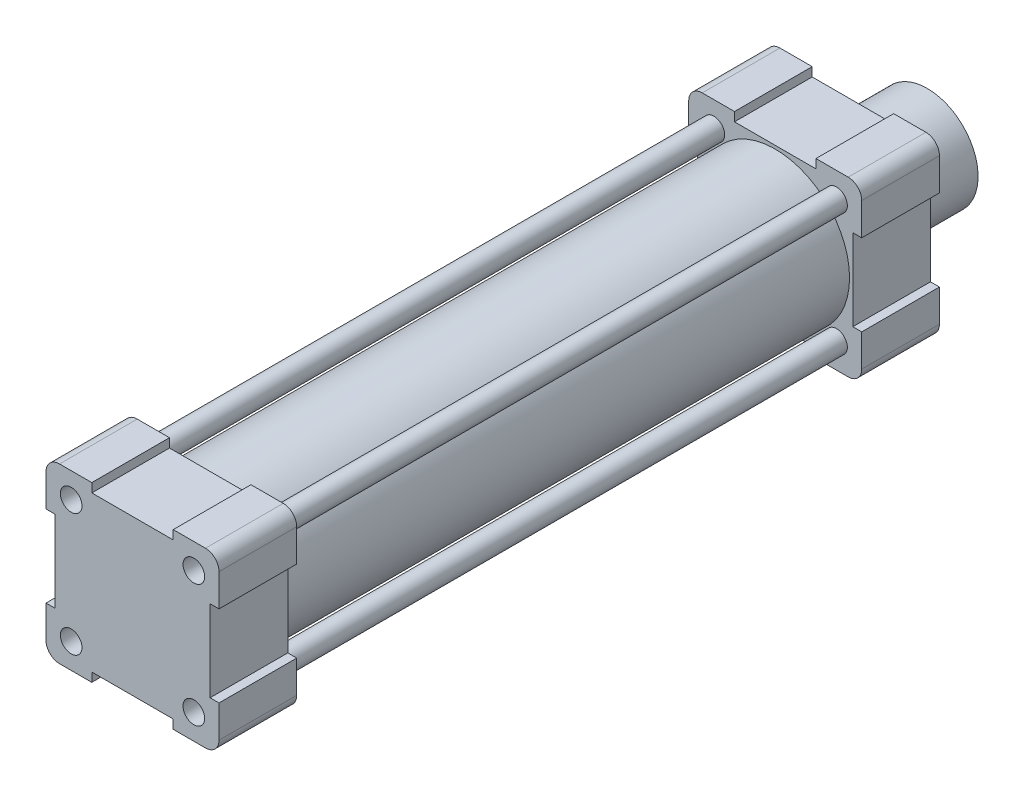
ISO-10303-21;
HEADER;
FILE_DESCRIPTION(('STEP AP214'),'2;1');
FILE_NAME('part.step','',(''),(''),'','','');
FILE_SCHEMA(('AUTOMOTIVE_DESIGN { 1 0 10303 214 1 1 1 1 }'));
ENDSEC;
DATA;
#1=APPLICATION_CONTEXT('core data for automotive mechanical design processes');
#2=APPLICATION_PROTOCOL_DEFINITION('international standard','automotive_design',2000,#1);
#3=PRODUCT_CONTEXT('',#1,'mechanical');
#4=PRODUCT('Part','Part','',(#3));
#5=PRODUCT_RELATED_PRODUCT_CATEGORY('part','',(#4));
#6=PRODUCT_DEFINITION_FORMATION('','',#4);
#7=PRODUCT_DEFINITION_CONTEXT('part definition',#1,'design');
#8=PRODUCT_DEFINITION('design','',#6,#7);
#9=PRODUCT_DEFINITION_SHAPE('','',#8);
#10=(LENGTH_UNIT() NAMED_UNIT(*) SI_UNIT(.MILLI.,.METRE.));
#11=(NAMED_UNIT(*) PLANE_ANGLE_UNIT() SI_UNIT($,.RADIAN.));
#12=(NAMED_UNIT(*) SI_UNIT($,.STERADIAN.) SOLID_ANGLE_UNIT());
#13=UNCERTAINTY_MEASURE_WITH_UNIT(LENGTH_MEASURE(1.E-05),#10,'distance_accuracy_value','');
#14=(GEOMETRIC_REPRESENTATION_CONTEXT(3) GLOBAL_UNCERTAINTY_ASSIGNED_CONTEXT((#13)) GLOBAL_UNIT_ASSIGNED_CONTEXT((#10,
#11,#12)) REPRESENTATION_CONTEXT('',''));
#15=CARTESIAN_POINT('',(0.,0.,0.));
#16=DIRECTION('',(0.,0.,1.));
#17=DIRECTION('',(1.,0.,0.));
#18=AXIS2_PLACEMENT_3D('',#15,#16,#17);
#19=CARTESIAN_POINT('',(27.,27.,0.));
#20=DIRECTION('',(0.,0.,-1.));
#21=DIRECTION('',(1.,0.,0.));
#22=AXIS2_PLACEMENT_3D('',#19,#20,#21);
#23=PLANE('',#22);
#24=CARTESIAN_POINT('',(22.69,-22.69,0.));
#25=DIRECTION('',(0.,0.,-1.));
#26=DIRECTION('',(-1.,0.,0.));
#27=AXIS2_PLACEMENT_3D('',#24,#25,#26);
#28=CIRCLE('',#27,4.);
#29=CARTESIAN_POINT('',(26.69,-22.69,0.));
#30=VERTEX_POINT('',#29);
#31=EDGE_CURVE('E11',#30,#30,#28,.F.);
#32=ORIENTED_EDGE('',*,*,#31,.F.);
#33=EDGE_LOOP('',(#32));
#34=FACE_BOUND('',#33,.T.);
#35=ADVANCED_FACE('F42',(#34),#23,.T.);
#36=CARTESIAN_POINT('',(22.69,-22.69,209.));
#37=DIRECTION('',(0.,0.,1.));
#38=DIRECTION('',(1.,0.,0.));
#39=AXIS2_PLACEMENT_3D('',#36,#37,#38);
#40=PLANE('',#39);
#41=CARTESIAN_POINT('',(22.69,-22.69,209.));
#42=DIRECTION('',(0.,0.,1.));
#43=DIRECTION('',(1.,0.,0.));
#44=AXIS2_PLACEMENT_3D('',#41,#42,#43);
#45=CIRCLE('',#44,4.);
#46=CARTESIAN_POINT('',(26.69,-22.69,209.));
#47=VERTEX_POINT('',#46);
#48=EDGE_CURVE('E48',#47,#47,#45,.T.);
#49=ORIENTED_EDGE('',*,*,#48,.T.);
#50=EDGE_LOOP('',(#49));
#51=FACE_BOUND('',#50,.T.);
#52=ADVANCED_FACE('F54',(#51),#40,.T.);
#53=CARTESIAN_POINT('',(22.69,-22.69,-11.3137084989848));
#54=DIRECTION('',(0.,0.,1.));
#55=DIRECTION('',(1.,0.,0.));
#56=AXIS2_PLACEMENT_3D('',#53,#54,#55);
#57=CYLINDRICAL_SURFACE('',#56,4.);
#58=CARTESIAN_POINT('',(26.69,-22.69,209.));
#59=CARTESIAN_POINT('',(26.69,-22.69,206.822916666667));
#60=CARTESIAN_POINT('',(26.69,-22.69,204.645833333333));
#61=CARTESIAN_POINT('',(26.69,-22.69,200.291666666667));
#62=CARTESIAN_POINT('',(26.69,-22.69,198.114583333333));
#63=CARTESIAN_POINT('',(26.69,-22.69,193.760416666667));
#64=CARTESIAN_POINT('',(26.69,-22.69,191.583333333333));
#65=CARTESIAN_POINT('',(26.69,-22.69,187.229166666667));
#66=CARTESIAN_POINT('',(26.69,-22.69,185.052083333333));
#67=CARTESIAN_POINT('',(26.69,-22.69,180.697916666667));
#68=CARTESIAN_POINT('',(26.69,-22.69,178.520833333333));
#69=CARTESIAN_POINT('',(26.69,-22.69,174.166666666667));
#70=CARTESIAN_POINT('',(26.69,-22.69,171.989583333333));
#71=CARTESIAN_POINT('',(26.69,-22.69,167.635416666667));
#72=CARTESIAN_POINT('',(26.69,-22.69,165.458333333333));
#73=CARTESIAN_POINT('',(26.69,-22.69,161.104166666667));
#74=CARTESIAN_POINT('',(26.69,-22.69,158.927083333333));
#75=CARTESIAN_POINT('',(26.69,-22.69,154.572916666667));
#76=CARTESIAN_POINT('',(26.69,-22.69,152.395833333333));
#77=CARTESIAN_POINT('',(26.69,-22.69,148.041666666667));
#78=CARTESIAN_POINT('',(26.69,-22.69,145.864583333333));
#79=CARTESIAN_POINT('',(26.69,-22.69,141.510416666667));
#80=CARTESIAN_POINT('',(26.69,-22.69,139.333333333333));
#81=CARTESIAN_POINT('',(26.69,-22.69,134.979166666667));
#82=CARTESIAN_POINT('',(26.69,-22.69,132.802083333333));
#83=CARTESIAN_POINT('',(26.69,-22.69,128.447916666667));
#84=CARTESIAN_POINT('',(26.69,-22.69,126.270833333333));
#85=CARTESIAN_POINT('',(26.69,-22.69,121.916666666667));
#86=CARTESIAN_POINT('',(26.69,-22.69,119.739583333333));
#87=CARTESIAN_POINT('',(26.69,-22.69,115.385416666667));
#88=CARTESIAN_POINT('',(26.69,-22.69,113.208333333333));
#89=CARTESIAN_POINT('',(26.69,-22.69,108.854166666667));
#90=CARTESIAN_POINT('',(26.69,-22.69,106.677083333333));
#91=CARTESIAN_POINT('',(26.69,-22.69,102.322916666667));
#92=CARTESIAN_POINT('',(26.69,-22.69,100.145833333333));
#93=CARTESIAN_POINT('',(26.69,-22.69,95.7916666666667));
#94=CARTESIAN_POINT('',(26.69,-22.69,93.6145833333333));
#95=CARTESIAN_POINT('',(26.69,-22.69,89.2604166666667));
#96=CARTESIAN_POINT('',(26.69,-22.69,87.0833333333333));
#97=CARTESIAN_POINT('',(26.69,-22.69,82.7291666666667));
#98=CARTESIAN_POINT('',(26.69,-22.69,80.5520833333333));
#99=CARTESIAN_POINT('',(26.69,-22.69,76.1979166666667));
#100=CARTESIAN_POINT('',(26.69,-22.69,74.0208333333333));
#101=CARTESIAN_POINT('',(26.69,-22.69,69.6666666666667));
#102=CARTESIAN_POINT('',(26.69,-22.69,67.4895833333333));
#103=CARTESIAN_POINT('',(26.69,-22.69,63.1354166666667));
#104=CARTESIAN_POINT('',(26.69,-22.69,60.9583333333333));
#105=CARTESIAN_POINT('',(26.69,-22.69,56.6041666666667));
#106=CARTESIAN_POINT('',(26.69,-22.69,54.4270833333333));
#107=CARTESIAN_POINT('',(26.69,-22.69,50.0729166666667));
#108=CARTESIAN_POINT('',(26.69,-22.69,47.8958333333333));
#109=CARTESIAN_POINT('',(26.69,-22.69,43.5416666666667));
#110=CARTESIAN_POINT('',(26.69,-22.69,41.3645833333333));
#111=CARTESIAN_POINT('',(26.69,-22.69,37.0104166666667));
#112=CARTESIAN_POINT('',(26.69,-22.69,34.8333333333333));
#113=CARTESIAN_POINT('',(26.69,-22.69,30.4791666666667));
#114=CARTESIAN_POINT('',(26.69,-22.69,28.3020833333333));
#115=CARTESIAN_POINT('',(26.69,-22.69,23.9479166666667));
#116=CARTESIAN_POINT('',(26.69,-22.69,21.7708333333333));
#117=CARTESIAN_POINT('',(26.69,-22.69,17.4166666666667));
#118=CARTESIAN_POINT('',(26.69,-22.69,15.2395833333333));
#119=CARTESIAN_POINT('',(26.69,-22.69,10.8854166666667));
#120=CARTESIAN_POINT('',(26.69,-22.69,8.70833333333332));
#121=CARTESIAN_POINT('',(26.69,-22.69,4.35416666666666));
#122=CARTESIAN_POINT('',(26.69,-22.69,2.17708333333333));
#123=CARTESIAN_POINT('',(26.69,-22.69,0.));
#124=B_SPLINE_CURVE_WITH_KNOTS('',3,(#58,#59,#60,#61,#62,#63,#64,#65,#66,#67,#68,#69,#70,#71,
#72,#73,#74,#75,#76,#77,#78,#79,#80,#81,#82,#83,#84,#85,#86,#87,#88,#89,#90,#91,#92,#93,#94,#95,
#96,#97,#98,#99,#100,#101,#102,#103,#104,#105,#106,#107,#108,#109,#110,#111,#112,#113,#114,#115,
#116,#117,#118,#119,#120,#121,#122,#123),.UNSPECIFIED.,.F.,.F.,(4,2,2,2,2,2,2,2,2,2,2,2,2,2,2,2,
2,2,2,2,2,2,2,2,2,2,2,2,2,2,2,2,4),(0.,6.53124999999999,13.0625,19.59375,26.125,32.65625,
39.1875,45.71875,52.25,58.78125,65.3125,71.84375,78.375,84.90625,91.4375,97.96875,104.5,
111.03125,117.5625,124.09375,130.625,137.15625,143.6875,150.21875,156.75,163.28125,169.8125,
176.34375,182.875,189.40625,195.9375,202.46875,209.),.UNSPECIFIED.);
#125=EDGE_CURVE('BSEAM56',#47,#30,#124,.T.);
#126=ORIENTED_EDGE('',*,*,#48,.F.);
#127=ORIENTED_EDGE('',*,*,#31,.T.);
#128=ORIENTED_EDGE('',*,*,#125,.T.);
#129=ORIENTED_EDGE('',*,*,#125,.F.);
#130=EDGE_LOOP('',(#126,#128,#127,#129));
#131=FACE_BOUND('',#130,.T.);
#132=ADVANCED_FACE('F56',(#131),#57,.T.);
#133=CLOSED_SHELL('',(#35,#52,#132));
#134=MANIFOLD_SOLID_BREP('B2',#133);
#135=CARTESIAN_POINT('',(27.,27.,0.));
#136=DIRECTION('',(0.,0.,-1.));
#137=DIRECTION('',(1.,0.,0.));
#138=AXIS2_PLACEMENT_3D('',#135,#136,#137);
#139=PLANE('',#138);
#140=CARTESIAN_POINT('',(-22.69,-22.69,0.));
#141=DIRECTION('',(0.,0.,-1.));
#142=DIRECTION('',(-1.,0.,0.));
#143=AXIS2_PLACEMENT_3D('',#140,#141,#142);
#144=CIRCLE('',#143,4.);
#145=CARTESIAN_POINT('',(-18.69,-22.69,0.));
#146=VERTEX_POINT('',#145);
#147=EDGE_CURVE('E41',#146,#146,#144,.F.);
#148=ORIENTED_EDGE('',*,*,#147,.F.);
#149=EDGE_LOOP('',(#148));
#150=FACE_BOUND('',#149,.T.);
#151=ADVANCED_FACE('F91',(#150),#139,.T.);
#152=CARTESIAN_POINT('',(-22.69,-22.69,209.));
#153=DIRECTION('',(0.,0.,1.));
#154=DIRECTION('',(1.,0.,0.));
#155=AXIS2_PLACEMENT_3D('',#152,#153,#154);
#156=PLANE('',#155);
#157=CARTESIAN_POINT('',(-22.69,-22.69,209.));
#158=DIRECTION('',(0.,0.,1.));
#159=DIRECTION('',(1.,0.,0.));
#160=AXIS2_PLACEMENT_3D('',#157,#158,#159);
#161=CIRCLE('',#160,4.);
#162=CARTESIAN_POINT('',(-18.69,-22.69,209.));
#163=VERTEX_POINT('',#162);
#164=EDGE_CURVE('E97',#163,#163,#161,.T.);
#165=ORIENTED_EDGE('',*,*,#164,.T.);
#166=EDGE_LOOP('',(#165));
#167=FACE_BOUND('',#166,.T.);
#168=ADVANCED_FACE('F103',(#167),#156,.T.);
#169=CARTESIAN_POINT('',(-22.69,-22.69,-11.3137084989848));
#170=DIRECTION('',(0.,0.,1.));
#171=DIRECTION('',(1.,0.,0.));
#172=AXIS2_PLACEMENT_3D('',#169,#170,#171);
#173=CYLINDRICAL_SURFACE('',#172,4.);
#174=CARTESIAN_POINT('',(-18.69,-22.69,209.));
#175=CARTESIAN_POINT('',(-18.69,-22.69,206.822916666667));
#176=CARTESIAN_POINT('',(-18.69,-22.69,204.645833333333));
#177=CARTESIAN_POINT('',(-18.69,-22.69,200.291666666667));
#178=CARTESIAN_POINT('',(-18.69,-22.69,198.114583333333));
#179=CARTESIAN_POINT('',(-18.69,-22.69,193.760416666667));
#180=CARTESIAN_POINT('',(-18.69,-22.69,191.583333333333));
#181=CARTESIAN_POINT('',(-18.69,-22.69,187.229166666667));
#182=CARTESIAN_POINT('',(-18.69,-22.69,185.052083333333));
#183=CARTESIAN_POINT('',(-18.69,-22.69,180.697916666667));
#184=CARTESIAN_POINT('',(-18.69,-22.69,178.520833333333));
#185=CARTESIAN_POINT('',(-18.69,-22.69,174.166666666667));
#186=CARTESIAN_POINT('',(-18.69,-22.69,171.989583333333));
#187=CARTESIAN_POINT('',(-18.69,-22.69,167.635416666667));
#188=CARTESIAN_POINT('',(-18.69,-22.69,165.458333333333));
#189=CARTESIAN_POINT('',(-18.69,-22.69,161.104166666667));
#190=CARTESIAN_POINT('',(-18.69,-22.69,158.927083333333));
#191=CARTESIAN_POINT('',(-18.69,-22.69,154.572916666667));
#192=CARTESIAN_POINT('',(-18.69,-22.69,152.395833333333));
#193=CARTESIAN_POINT('',(-18.69,-22.69,148.041666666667));
#194=CARTESIAN_POINT('',(-18.69,-22.69,145.864583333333));
#195=CARTESIAN_POINT('',(-18.69,-22.69,141.510416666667));
#196=CARTESIAN_POINT('',(-18.69,-22.69,139.333333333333));
#197=CARTESIAN_POINT('',(-18.69,-22.69,134.979166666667));
#198=CARTESIAN_POINT('',(-18.69,-22.69,132.802083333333));
#199=CARTESIAN_POINT('',(-18.69,-22.69,128.447916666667));
#200=CARTESIAN_POINT('',(-18.69,-22.69,126.270833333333));
#201=CARTESIAN_POINT('',(-18.69,-22.69,121.916666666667));
#202=CARTESIAN_POINT('',(-18.69,-22.69,119.739583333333));
#203=CARTESIAN_POINT('',(-18.69,-22.69,115.385416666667));
#204=CARTESIAN_POINT('',(-18.69,-22.69,113.208333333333));
#205=CARTESIAN_POINT('',(-18.69,-22.69,108.854166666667));
#206=CARTESIAN_POINT('',(-18.69,-22.69,106.677083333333));
#207=CARTESIAN_POINT('',(-18.69,-22.69,102.322916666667));
#208=CARTESIAN_POINT('',(-18.69,-22.69,100.145833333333));
#209=CARTESIAN_POINT('',(-18.69,-22.69,95.7916666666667));
#210=CARTESIAN_POINT('',(-18.69,-22.69,93.6145833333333));
#211=CARTESIAN_POINT('',(-18.69,-22.69,89.2604166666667));
#212=CARTESIAN_POINT('',(-18.69,-22.69,87.0833333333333));
#213=CARTESIAN_POINT('',(-18.69,-22.69,82.7291666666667));
#214=CARTESIAN_POINT('',(-18.69,-22.69,80.5520833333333));
#215=CARTESIAN_POINT('',(-18.69,-22.69,76.1979166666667));
#216=CARTESIAN_POINT('',(-18.69,-22.69,74.0208333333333));
#217=CARTESIAN_POINT('',(-18.69,-22.69,69.6666666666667));
#218=CARTESIAN_POINT('',(-18.69,-22.69,67.4895833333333));
#219=CARTESIAN_POINT('',(-18.69,-22.69,63.1354166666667));
#220=CARTESIAN_POINT('',(-18.69,-22.69,60.9583333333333));
#221=CARTESIAN_POINT('',(-18.69,-22.69,56.6041666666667));
#222=CARTESIAN_POINT('',(-18.69,-22.69,54.4270833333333));
#223=CARTESIAN_POINT('',(-18.69,-22.69,50.0729166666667));
#224=CARTESIAN_POINT('',(-18.69,-22.69,47.8958333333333));
#225=CARTESIAN_POINT('',(-18.69,-22.69,43.5416666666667));
#226=CARTESIAN_POINT('',(-18.69,-22.69,41.3645833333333));
#227=CARTESIAN_POINT('',(-18.69,-22.69,37.0104166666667));
#228=CARTESIAN_POINT('',(-18.69,-22.69,34.8333333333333));
#229=CARTESIAN_POINT('',(-18.69,-22.69,30.4791666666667));
#230=CARTESIAN_POINT('',(-18.69,-22.69,28.3020833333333));
#231=CARTESIAN_POINT('',(-18.69,-22.69,23.9479166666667));
#232=CARTESIAN_POINT('',(-18.69,-22.69,21.7708333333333));
#233=CARTESIAN_POINT('',(-18.69,-22.69,17.4166666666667));
#234=CARTESIAN_POINT('',(-18.69,-22.69,15.2395833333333));
#235=CARTESIAN_POINT('',(-18.69,-22.69,10.8854166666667));
#236=CARTESIAN_POINT('',(-18.69,-22.69,8.70833333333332));
#237=CARTESIAN_POINT('',(-18.69,-22.69,4.35416666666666));
#238=CARTESIAN_POINT('',(-18.69,-22.69,2.17708333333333));
#239=CARTESIAN_POINT('',(-18.69,-22.69,0.));
#240=B_SPLINE_CURVE_WITH_KNOTS('',3,(#174,#175,#176,#177,#178,#179,#180,#181,#182,#183,#184,
#185,#186,#187,#188,#189,#190,#191,#192,#193,#194,#195,#196,#197,#198,#199,#200,#201,#202,#203,
#204,#205,#206,#207,#208,#209,#210,#211,#212,#213,#214,#215,#216,#217,#218,#219,#220,#221,#222,
#223,#224,#225,#226,#227,#228,#229,#230,#231,#232,#233,#234,#235,#236,#237,#238,#239),
.UNSPECIFIED.,.F.,.F.,(4,2,2,2,2,2,2,2,2,2,2,2,2,2,2,2,2,2,2,2,2,2,2,2,2,2,2,2,2,2,2,2,4),(0.,
6.53124999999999,13.0625,19.59375,26.125,32.65625,39.1875,45.71875,52.25,58.78125,65.3125,
71.84375,78.375,84.90625,91.4375,97.96875,104.5,111.03125,117.5625,124.09375,130.625,137.15625,
143.6875,150.21875,156.75,163.28125,169.8125,176.34375,182.875,189.40625,195.9375,202.46875,
209.),.UNSPECIFIED.);
#241=EDGE_CURVE('BSEAM105',#163,#146,#240,.T.);
#242=ORIENTED_EDGE('',*,*,#164,.F.);
#243=ORIENTED_EDGE('',*,*,#147,.T.);
#244=ORIENTED_EDGE('',*,*,#241,.T.);
#245=ORIENTED_EDGE('',*,*,#241,.F.);
#246=EDGE_LOOP('',(#242,#244,#243,#245));
#247=FACE_BOUND('',#246,.T.);
#248=ADVANCED_FACE('F105',(#247),#173,.T.);
#249=CLOSED_SHELL('',(#151,#168,#248));
#250=MANIFOLD_SOLID_BREP('B6',#249);
#251=CARTESIAN_POINT('',(27.,27.,0.));
#252=DIRECTION('',(0.,0.,-1.));
#253=DIRECTION('',(1.,0.,0.));
#254=AXIS2_PLACEMENT_3D('',#251,#252,#253);
#255=PLANE('',#254);
#256=CARTESIAN_POINT('',(-22.69,22.69,0.));
#257=DIRECTION('',(0.,0.,-1.));
#258=DIRECTION('',(-1.,0.,0.));
#259=AXIS2_PLACEMENT_3D('',#256,#257,#258);
#260=CIRCLE('',#259,4.);
#261=CARTESIAN_POINT('',(-18.69,22.69,0.));
#262=VERTEX_POINT('',#261);
#263=EDGE_CURVE('E90',#262,#262,#260,.F.);
#264=ORIENTED_EDGE('',*,*,#263,.F.);
#265=EDGE_LOOP('',(#264));
#266=FACE_BOUND('',#265,.T.);
#267=ADVANCED_FACE('F140',(#266),#255,.T.);
#268=CARTESIAN_POINT('',(-22.69,22.69,209.));
#269=DIRECTION('',(0.,0.,1.));
#270=DIRECTION('',(1.,0.,0.));
#271=AXIS2_PLACEMENT_3D('',#268,#269,#270);
#272=PLANE('',#271);
#273=CARTESIAN_POINT('',(-22.69,22.69,209.));
#274=DIRECTION('',(0.,0.,1.));
#275=DIRECTION('',(1.,0.,0.));
#276=AXIS2_PLACEMENT_3D('',#273,#274,#275);
#277=CIRCLE('',#276,4.);
#278=CARTESIAN_POINT('',(-18.69,22.69,209.));
#279=VERTEX_POINT('',#278);
#280=EDGE_CURVE('E146',#279,#279,#277,.T.);
#281=ORIENTED_EDGE('',*,*,#280,.T.);
#282=EDGE_LOOP('',(#281));
#283=FACE_BOUND('',#282,.T.);
#284=ADVANCED_FACE('F152',(#283),#272,.T.);
#285=CARTESIAN_POINT('',(-22.69,22.69,-11.3137084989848));
#286=DIRECTION('',(0.,0.,1.));
#287=DIRECTION('',(1.,0.,0.));
#288=AXIS2_PLACEMENT_3D('',#285,#286,#287);
#289=CYLINDRICAL_SURFACE('',#288,4.);
#290=CARTESIAN_POINT('',(-18.69,22.69,209.));
#291=CARTESIAN_POINT('',(-18.69,22.69,206.822916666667));
#292=CARTESIAN_POINT('',(-18.69,22.69,204.645833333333));
#293=CARTESIAN_POINT('',(-18.69,22.69,200.291666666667));
#294=CARTESIAN_POINT('',(-18.69,22.69,198.114583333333));
#295=CARTESIAN_POINT('',(-18.69,22.69,193.760416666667));
#296=CARTESIAN_POINT('',(-18.69,22.69,191.583333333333));
#297=CARTESIAN_POINT('',(-18.69,22.69,187.229166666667));
#298=CARTESIAN_POINT('',(-18.69,22.69,185.052083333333));
#299=CARTESIAN_POINT('',(-18.69,22.69,180.697916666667));
#300=CARTESIAN_POINT('',(-18.69,22.69,178.520833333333));
#301=CARTESIAN_POINT('',(-18.69,22.69,174.166666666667));
#302=CARTESIAN_POINT('',(-18.69,22.69,171.989583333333));
#303=CARTESIAN_POINT('',(-18.69,22.69,167.635416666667));
#304=CARTESIAN_POINT('',(-18.69,22.69,165.458333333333));
#305=CARTESIAN_POINT('',(-18.69,22.69,161.104166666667));
#306=CARTESIAN_POINT('',(-18.69,22.69,158.927083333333));
#307=CARTESIAN_POINT('',(-18.69,22.69,154.572916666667));
#308=CARTESIAN_POINT('',(-18.69,22.69,152.395833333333));
#309=CARTESIAN_POINT('',(-18.69,22.69,148.041666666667));
#310=CARTESIAN_POINT('',(-18.69,22.69,145.864583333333));
#311=CARTESIAN_POINT('',(-18.69,22.69,141.510416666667));
#312=CARTESIAN_POINT('',(-18.69,22.69,139.333333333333));
#313=CARTESIAN_POINT('',(-18.69,22.69,134.979166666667));
#314=CARTESIAN_POINT('',(-18.69,22.69,132.802083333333));
#315=CARTESIAN_POINT('',(-18.69,22.69,128.447916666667));
#316=CARTESIAN_POINT('',(-18.69,22.69,126.270833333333));
#317=CARTESIAN_POINT('',(-18.69,22.69,121.916666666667));
#318=CARTESIAN_POINT('',(-18.69,22.69,119.739583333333));
#319=CARTESIAN_POINT('',(-18.69,22.69,115.385416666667));
#320=CARTESIAN_POINT('',(-18.69,22.69,113.208333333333));
#321=CARTESIAN_POINT('',(-18.69,22.69,108.854166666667));
#322=CARTESIAN_POINT('',(-18.69,22.69,106.677083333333));
#323=CARTESIAN_POINT('',(-18.69,22.69,102.322916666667));
#324=CARTESIAN_POINT('',(-18.69,22.69,100.145833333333));
#325=CARTESIAN_POINT('',(-18.69,22.69,95.7916666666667));
#326=CARTESIAN_POINT('',(-18.69,22.69,93.6145833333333));
#327=CARTESIAN_POINT('',(-18.69,22.69,89.2604166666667));
#328=CARTESIAN_POINT('',(-18.69,22.69,87.0833333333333));
#329=CARTESIAN_POINT('',(-18.69,22.69,82.7291666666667));
#330=CARTESIAN_POINT('',(-18.69,22.69,80.5520833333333));
#331=CARTESIAN_POINT('',(-18.69,22.69,76.1979166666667));
#332=CARTESIAN_POINT('',(-18.69,22.69,74.0208333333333));
#333=CARTESIAN_POINT('',(-18.69,22.69,69.6666666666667));
#334=CARTESIAN_POINT('',(-18.69,22.69,67.4895833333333));
#335=CARTESIAN_POINT('',(-18.69,22.69,63.1354166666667));
#336=CARTESIAN_POINT('',(-18.69,22.69,60.9583333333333));
#337=CARTESIAN_POINT('',(-18.69,22.69,56.6041666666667));
#338=CARTESIAN_POINT('',(-18.69,22.69,54.4270833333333));
#339=CARTESIAN_POINT('',(-18.69,22.69,50.0729166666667));
#340=CARTESIAN_POINT('',(-18.69,22.69,47.8958333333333));
#341=CARTESIAN_POINT('',(-18.69,22.69,43.5416666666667));
#342=CARTESIAN_POINT('',(-18.69,22.69,41.3645833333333));
#343=CARTESIAN_POINT('',(-18.69,22.69,37.0104166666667));
#344=CARTESIAN_POINT('',(-18.69,22.69,34.8333333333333));
#345=CARTESIAN_POINT('',(-18.69,22.69,30.4791666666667));
#346=CARTESIAN_POINT('',(-18.69,22.69,28.3020833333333));
#347=CARTESIAN_POINT('',(-18.69,22.69,23.9479166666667));
#348=CARTESIAN_POINT('',(-18.69,22.69,21.7708333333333));
#349=CARTESIAN_POINT('',(-18.69,22.69,17.4166666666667));
#350=CARTESIAN_POINT('',(-18.69,22.69,15.2395833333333));
#351=CARTESIAN_POINT('',(-18.69,22.69,10.8854166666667));
#352=CARTESIAN_POINT('',(-18.69,22.69,8.70833333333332));
#353=CARTESIAN_POINT('',(-18.69,22.69,4.35416666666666));
#354=CARTESIAN_POINT('',(-18.69,22.69,2.17708333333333));
#355=CARTESIAN_POINT('',(-18.69,22.69,0.));
#356=B_SPLINE_CURVE_WITH_KNOTS('',3,(#290,#291,#292,#293,#294,#295,#296,#297,#298,#299,#300,
#301,#302,#303,#304,#305,#306,#307,#308,#309,#310,#311,#312,#313,#314,#315,#316,#317,#318,#319,
#320,#321,#322,#323,#324,#325,#326,#327,#328,#329,#330,#331,#332,#333,#334,#335,#336,#337,#338,
#339,#340,#341,#342,#343,#344,#345,#346,#347,#348,#349,#350,#351,#352,#353,#354,#355),
.UNSPECIFIED.,.F.,.F.,(4,2,2,2,2,2,2,2,2,2,2,2,2,2,2,2,2,2,2,2,2,2,2,2,2,2,2,2,2,2,2,2,4),(0.,
6.53124999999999,13.0625,19.59375,26.125,32.65625,39.1875,45.71875,52.25,58.78125,65.3125,
71.84375,78.375,84.90625,91.4375,97.96875,104.5,111.03125,117.5625,124.09375,130.625,137.15625,
143.6875,150.21875,156.75,163.28125,169.8125,176.34375,182.875,189.40625,195.9375,202.46875,
209.),.UNSPECIFIED.);
#357=EDGE_CURVE('BSEAM154',#279,#262,#356,.T.);
#358=ORIENTED_EDGE('',*,*,#280,.F.);
#359=ORIENTED_EDGE('',*,*,#263,.T.);
#360=ORIENTED_EDGE('',*,*,#357,.T.);
#361=ORIENTED_EDGE('',*,*,#357,.F.);
#362=EDGE_LOOP('',(#358,#360,#359,#361));
#363=FACE_BOUND('',#362,.T.);
#364=ADVANCED_FACE('F154',(#363),#289,.T.);
#365=CLOSED_SHELL('',(#267,#284,#364));
#366=MANIFOLD_SOLID_BREP('B36',#365);
#367=CARTESIAN_POINT('',(27.,27.,0.));
#368=DIRECTION('',(0.,0.,-1.));
#369=DIRECTION('',(1.,0.,0.));
#370=AXIS2_PLACEMENT_3D('',#367,#368,#369);
#371=PLANE('',#370);
#372=CARTESIAN_POINT('',(22.69,22.69,0.));
#373=DIRECTION('',(0.,0.,-1.));
#374=DIRECTION('',(-1.,0.,0.));
#375=AXIS2_PLACEMENT_3D('',#372,#373,#374);
#376=CIRCLE('',#375,4.);
#377=CARTESIAN_POINT('',(26.69,22.69,0.));
#378=VERTEX_POINT('',#377);
#379=EDGE_CURVE('E139',#378,#378,#376,.F.);
#380=ORIENTED_EDGE('',*,*,#379,.F.);
#381=EDGE_LOOP('',(#380));
#382=FACE_BOUND('',#381,.T.);
#383=ADVANCED_FACE('F190',(#382),#371,.T.);
#384=CARTESIAN_POINT('',(22.69,22.69,209.));
#385=DIRECTION('',(0.,0.,1.));
#386=DIRECTION('',(1.,0.,0.));
#387=AXIS2_PLACEMENT_3D('',#384,#385,#386);
#388=PLANE('',#387);
#389=CARTESIAN_POINT('',(22.69,22.69,209.));
#390=DIRECTION('',(0.,0.,1.));
#391=DIRECTION('',(1.,0.,0.));
#392=AXIS2_PLACEMENT_3D('',#389,#390,#391);
#393=CIRCLE('',#392,4.);
#394=CARTESIAN_POINT('',(26.69,22.69,209.));
#395=VERTEX_POINT('',#394);
#396=EDGE_CURVE('E196',#395,#395,#393,.T.);
#397=ORIENTED_EDGE('',*,*,#396,.T.);
#398=EDGE_LOOP('',(#397));
#399=FACE_BOUND('',#398,.T.);
#400=ADVANCED_FACE('F202',(#399),#388,.T.);
#401=CARTESIAN_POINT('',(22.69,22.69,-11.3137084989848));
#402=DIRECTION('',(0.,0.,1.));
#403=DIRECTION('',(1.,0.,0.));
#404=AXIS2_PLACEMENT_3D('',#401,#402,#403);
#405=CYLINDRICAL_SURFACE('',#404,4.);
#406=CARTESIAN_POINT('',(26.69,22.69,209.));
#407=CARTESIAN_POINT('',(26.69,22.69,206.822916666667));
#408=CARTESIAN_POINT('',(26.69,22.69,204.645833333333));
#409=CARTESIAN_POINT('',(26.69,22.69,200.291666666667));
#410=CARTESIAN_POINT('',(26.69,22.69,198.114583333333));
#411=CARTESIAN_POINT('',(26.69,22.69,193.760416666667));
#412=CARTESIAN_POINT('',(26.69,22.69,191.583333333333));
#413=CARTESIAN_POINT('',(26.69,22.69,187.229166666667));
#414=CARTESIAN_POINT('',(26.69,22.69,185.052083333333));
#415=CARTESIAN_POINT('',(26.69,22.69,180.697916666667));
#416=CARTESIAN_POINT('',(26.69,22.69,178.520833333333));
#417=CARTESIAN_POINT('',(26.69,22.69,174.166666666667));
#418=CARTESIAN_POINT('',(26.69,22.69,171.989583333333));
#419=CARTESIAN_POINT('',(26.69,22.69,167.635416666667));
#420=CARTESIAN_POINT('',(26.69,22.69,165.458333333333));
#421=CARTESIAN_POINT('',(26.69,22.69,161.104166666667));
#422=CARTESIAN_POINT('',(26.69,22.69,158.927083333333));
#423=CARTESIAN_POINT('',(26.69,22.69,154.572916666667));
#424=CARTESIAN_POINT('',(26.69,22.69,152.395833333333));
#425=CARTESIAN_POINT('',(26.69,22.69,148.041666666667));
#426=CARTESIAN_POINT('',(26.69,22.69,145.864583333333));
#427=CARTESIAN_POINT('',(26.69,22.69,141.510416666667));
#428=CARTESIAN_POINT('',(26.69,22.69,139.333333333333));
#429=CARTESIAN_POINT('',(26.69,22.69,134.979166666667));
#430=CARTESIAN_POINT('',(26.69,22.69,132.802083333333));
#431=CARTESIAN_POINT('',(26.69,22.69,128.447916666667));
#432=CARTESIAN_POINT('',(26.69,22.69,126.270833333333));
#433=CARTESIAN_POINT('',(26.69,22.69,121.916666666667));
#434=CARTESIAN_POINT('',(26.69,22.69,119.739583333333));
#435=CARTESIAN_POINT('',(26.69,22.69,115.385416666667));
#436=CARTESIAN_POINT('',(26.69,22.69,113.208333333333));
#437=CARTESIAN_POINT('',(26.69,22.69,108.854166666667));
#438=CARTESIAN_POINT('',(26.69,22.69,106.677083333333));
#439=CARTESIAN_POINT('',(26.69,22.69,102.322916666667));
#440=CARTESIAN_POINT('',(26.69,22.69,100.145833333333));
#441=CARTESIAN_POINT('',(26.69,22.69,95.7916666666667));
#442=CARTESIAN_POINT('',(26.69,22.69,93.6145833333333));
#443=CARTESIAN_POINT('',(26.69,22.69,89.2604166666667));
#444=CARTESIAN_POINT('',(26.69,22.69,87.0833333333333));
#445=CARTESIAN_POINT('',(26.69,22.69,82.7291666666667));
#446=CARTESIAN_POINT('',(26.69,22.69,80.5520833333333));
#447=CARTESIAN_POINT('',(26.69,22.69,76.1979166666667));
#448=CARTESIAN_POINT('',(26.69,22.69,74.0208333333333));
#449=CARTESIAN_POINT('',(26.69,22.69,69.6666666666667));
#450=CARTESIAN_POINT('',(26.69,22.69,67.4895833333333));
#451=CARTESIAN_POINT('',(26.69,22.69,63.1354166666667));
#452=CARTESIAN_POINT('',(26.69,22.69,60.9583333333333));
#453=CARTESIAN_POINT('',(26.69,22.69,56.6041666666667));
#454=CARTESIAN_POINT('',(26.69,22.69,54.4270833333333));
#455=CARTESIAN_POINT('',(26.69,22.69,50.0729166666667));
#456=CARTESIAN_POINT('',(26.69,22.69,47.8958333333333));
#457=CARTESIAN_POINT('',(26.69,22.69,43.5416666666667));
#458=CARTESIAN_POINT('',(26.69,22.69,41.3645833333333));
#459=CARTESIAN_POINT('',(26.69,22.69,37.0104166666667));
#460=CARTESIAN_POINT('',(26.69,22.69,34.8333333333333));
#461=CARTESIAN_POINT('',(26.69,22.69,30.4791666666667));
#462=CARTESIAN_POINT('',(26.69,22.69,28.3020833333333));
#463=CARTESIAN_POINT('',(26.69,22.69,23.9479166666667));
#464=CARTESIAN_POINT('',(26.69,22.69,21.7708333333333));
#465=CARTESIAN_POINT('',(26.69,22.69,17.4166666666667));
#466=CARTESIAN_POINT('',(26.69,22.69,15.2395833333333));
#467=CARTESIAN_POINT('',(26.69,22.69,10.8854166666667));
#468=CARTESIAN_POINT('',(26.69,22.69,8.70833333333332));
#469=CARTESIAN_POINT('',(26.69,22.69,4.35416666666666));
#470=CARTESIAN_POINT('',(26.69,22.69,2.17708333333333));
#471=CARTESIAN_POINT('',(26.69,22.69,0.));
#472=B_SPLINE_CURVE_WITH_KNOTS('',3,(#406,#407,#408,#409,#410,#411,#412,#413,#414,#415,#416,
#417,#418,#419,#420,#421,#422,#423,#424,#425,#426,#427,#428,#429,#430,#431,#432,#433,#434,#435,
#436,#437,#438,#439,#440,#441,#442,#443,#444,#445,#446,#447,#448,#449,#450,#451,#452,#453,#454,
#455,#456,#457,#458,#459,#460,#461,#462,#463,#464,#465,#466,#467,#468,#469,#470,#471),
.UNSPECIFIED.,.F.,.F.,(4,2,2,2,2,2,2,2,2,2,2,2,2,2,2,2,2,2,2,2,2,2,2,2,2,2,2,2,2,2,2,2,4),(0.,
6.53124999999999,13.0625,19.59375,26.125,32.65625,39.1875,45.71875,52.25,58.78125,65.3125,
71.84375,78.375,84.90625,91.4375,97.96875,104.5,111.03125,117.5625,124.09375,130.625,137.15625,
143.6875,150.21875,156.75,163.28125,169.8125,176.34375,182.875,189.40625,195.9375,202.46875,
209.),.UNSPECIFIED.);
#473=EDGE_CURVE('BSEAM204',#395,#378,#472,.T.);
#474=ORIENTED_EDGE('',*,*,#396,.F.);
#475=ORIENTED_EDGE('',*,*,#379,.T.);
#476=ORIENTED_EDGE('',*,*,#473,.T.);
#477=ORIENTED_EDGE('',*,*,#473,.F.);
#478=EDGE_LOOP('',(#474,#476,#475,#477));
#479=FACE_BOUND('',#478,.T.);
#480=ADVANCED_FACE('F204',(#479),#405,.T.);
#481=CLOSED_SHELL('',(#383,#400,#480));
#482=MANIFOLD_SOLID_BREP('B85',#481);
#483=CARTESIAN_POINT('',(27.,27.,-28.75));
#484=DIRECTION('',(0.,0.,-1.));
#485=DIRECTION('',(1.,0.,0.));
#486=AXIS2_PLACEMENT_3D('',#483,#484,#485);
#487=PLANE('',#486);
#488=CARTESIAN_POINT('',(-22.69,-22.69,-28.75));
#489=DIRECTION('',(0.,0.,1.));
#490=DIRECTION('',(1.,0.,0.));
#491=AXIS2_PLACEMENT_3D('',#488,#489,#490);
#492=CIRCLE('',#491,4.);
#493=CARTESIAN_POINT('',(-18.69,-22.69,-28.75));
#494=VERTEX_POINT('',#493);
#495=EDGE_CURVE('E1214',#494,#494,#492,.T.);
#496=ORIENTED_EDGE('',*,*,#495,.T.);
#497=EDGE_LOOP('',(#496));
#498=FACE_BOUND('',#497,.T.);
#499=CARTESIAN_POINT('',(22.69,22.69,-28.75));
#500=DIRECTION('',(0.,0.,1.));
#501=DIRECTION('',(1.,0.,0.));
#502=AXIS2_PLACEMENT_3D('',#499,#500,#501);
#503=CIRCLE('',#502,4.);
#504=CARTESIAN_POINT('',(26.69,22.69,-28.75));
#505=VERTEX_POINT('',#504);
#506=EDGE_CURVE('E1225',#505,#505,#503,.T.);
#507=ORIENTED_EDGE('',*,*,#506,.T.);
#508=EDGE_LOOP('',(#507));
#509=FACE_BOUND('',#508,.T.);
#510=DIRECTION('',(0.,1.,0.));
#511=VECTOR('',#510,1.);
#512=CARTESIAN_POINT('',(-15.065,32.,-28.75));
#513=LINE('',#512,#511);
#514=CARTESIAN_POINT('',(-15.065,28.69,-28.75));
#515=VERTEX_POINT('',#514);
#516=CARTESIAN_POINT('',(-15.065,32.,-28.75));
#517=VERTEX_POINT('',#516);
#518=EDGE_CURVE('E1237',#515,#517,#513,.T.);
#519=ORIENTED_EDGE('',*,*,#518,.F.);
#520=DIRECTION('',(-1.,0.,0.));
#521=VECTOR('',#520,1.);
#522=CARTESIAN_POINT('',(-15.065,28.69,-28.75));
#523=LINE('',#522,#521);
#524=CARTESIAN_POINT('',(15.065,28.69,-28.75));
#525=VERTEX_POINT('',#524);
#526=EDGE_CURVE('E1307',#525,#515,#523,.T.);
#527=ORIENTED_EDGE('',*,*,#526,.F.);
#528=DIRECTION('',(0.,-1.,0.));
#529=VECTOR('',#528,1.);
#530=CARTESIAN_POINT('',(15.065,32.,-28.75));
#531=LINE('',#530,#529);
#532=CARTESIAN_POINT('',(15.065,32.,-28.75));
#533=VERTEX_POINT('',#532);
#534=EDGE_CURVE('E1304',#533,#525,#531,.T.);
#535=ORIENTED_EDGE('',*,*,#534,.F.);
#536=DIRECTION('',(-1.,0.,0.));
#537=VECTOR('',#536,1.);
#538=CARTESIAN_POINT('',(27.,32.,-28.75));
#539=LINE('',#538,#537);
#540=CARTESIAN_POINT('',(27.,32.,-28.75));
#541=VERTEX_POINT('',#540);
#542=EDGE_CURVE('E1301',#541,#533,#539,.T.);
#543=ORIENTED_EDGE('',*,*,#542,.F.);
#544=CARTESIAN_POINT('',(27.,27.,-28.75));
#545=DIRECTION('',(0.,0.,1.));
#546=DIRECTION('',(1.,0.,0.));
#547=AXIS2_PLACEMENT_3D('',#544,#545,#546);
#548=CIRCLE('',#547,5.);
#549=CARTESIAN_POINT('',(32.,27.,-28.75));
#550=VERTEX_POINT('',#549);
#551=EDGE_CURVE('E1298',#550,#541,#548,.T.);
#552=ORIENTED_EDGE('',*,*,#551,.F.);
#553=DIRECTION('',(0.,1.,0.));
#554=VECTOR('',#553,1.);
#555=CARTESIAN_POINT('',(32.,15.065,-28.75));
#556=LINE('',#555,#554);
#557=CARTESIAN_POINT('',(32.,15.065,-28.75));
#558=VERTEX_POINT('',#557);
#559=EDGE_CURVE('E1295',#558,#550,#556,.T.);
#560=ORIENTED_EDGE('',*,*,#559,.F.);
#561=DIRECTION('',(1.,0.,0.));
#562=VECTOR('',#561,1.);
#563=CARTESIAN_POINT('',(32.,15.065,-28.75));
#564=LINE('',#563,#562);
#565=CARTESIAN_POINT('',(28.69,15.065,-28.75));
#566=VERTEX_POINT('',#565);
#567=EDGE_CURVE('E1292',#566,#558,#564,.T.);
#568=ORIENTED_EDGE('',*,*,#567,.F.);
#569=DIRECTION('',(0.,1.,0.));
#570=VECTOR('',#569,1.);
#571=CARTESIAN_POINT('',(28.69,15.065,-28.75));
#572=LINE('',#571,#570);
#573=CARTESIAN_POINT('',(28.69,-15.065,-28.75));
#574=VERTEX_POINT('',#573);
#575=EDGE_CURVE('E1289',#574,#566,#572,.T.);
#576=ORIENTED_EDGE('',*,*,#575,.F.);
#577=DIRECTION('',(-1.,0.,0.));
#578=VECTOR('',#577,1.);
#579=CARTESIAN_POINT('',(32.,-15.065,-28.75));
#580=LINE('',#579,#578);
#581=CARTESIAN_POINT('',(32.,-15.065,-28.75));
#582=VERTEX_POINT('',#581);
#583=EDGE_CURVE('E1286',#582,#574,#580,.T.);
#584=ORIENTED_EDGE('',*,*,#583,.F.);
#585=DIRECTION('',(0.,1.,0.));
#586=VECTOR('',#585,1.);
#587=CARTESIAN_POINT('',(32.,-27.,-28.75));
#588=LINE('',#587,#586);
#589=CARTESIAN_POINT('',(32.,-27.,-28.75));
#590=VERTEX_POINT('',#589);
#591=EDGE_CURVE('E1283',#590,#582,#588,.T.);
#592=ORIENTED_EDGE('',*,*,#591,.F.);
#593=CARTESIAN_POINT('',(27.,-27.,-28.75));
#594=DIRECTION('',(0.,0.,1.));
#595=DIRECTION('',(1.,0.,0.));
#596=AXIS2_PLACEMENT_3D('',#593,#594,#595);
#597=CIRCLE('',#596,5.);
#598=CARTESIAN_POINT('',(27.,-32.,-28.75));
#599=VERTEX_POINT('',#598);
#600=EDGE_CURVE('E1280',#599,#590,#597,.T.);
#601=ORIENTED_EDGE('',*,*,#600,.F.);
#602=DIRECTION('',(1.,0.,0.));
#603=VECTOR('',#602,1.);
#604=CARTESIAN_POINT('',(27.,-32.,-28.75));
#605=LINE('',#604,#603);
#606=CARTESIAN_POINT('',(15.065,-32.,-28.75));
#607=VERTEX_POINT('',#606);
#608=EDGE_CURVE('E1277',#607,#599,#605,.T.);
#609=ORIENTED_EDGE('',*,*,#608,.F.);
#610=DIRECTION('',(0.,-1.,0.));
#611=VECTOR('',#610,1.);
#612=CARTESIAN_POINT('',(15.065,-32.,-28.75));
#613=LINE('',#612,#611);
#614=CARTESIAN_POINT('',(15.065,-28.69,-28.75));
#615=VERTEX_POINT('',#614);
#616=EDGE_CURVE('E1274',#615,#607,#613,.T.);
#617=ORIENTED_EDGE('',*,*,#616,.F.);
#618=DIRECTION('',(1.,0.,0.));
#619=VECTOR('',#618,1.);
#620=CARTESIAN_POINT('',(-15.065,-28.69,-28.75));
#621=LINE('',#620,#619);
#622=CARTESIAN_POINT('',(-15.065,-28.69,-28.75));
#623=VERTEX_POINT('',#622);
#624=EDGE_CURVE('E1271',#623,#615,#621,.T.);
#625=ORIENTED_EDGE('',*,*,#624,.F.);
#626=DIRECTION('',(0.,1.,0.));
#627=VECTOR('',#626,1.);
#628=CARTESIAN_POINT('',(-15.065,-32.,-28.75));
#629=LINE('',#628,#627);
#630=CARTESIAN_POINT('',(-15.065,-32.,-28.75));
#631=VERTEX_POINT('',#630);
#632=EDGE_CURVE('E1268',#631,#623,#629,.T.);
#633=ORIENTED_EDGE('',*,*,#632,.F.);
#634=DIRECTION('',(1.,0.,0.));
#635=VECTOR('',#634,1.);
#636=CARTESIAN_POINT('',(-15.065,-32.,-28.75));
#637=LINE('',#636,#635);
#638=CARTESIAN_POINT('',(-26.9999999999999,-32.,-28.75));
#639=VERTEX_POINT('',#638);
#640=EDGE_CURVE('E1265',#639,#631,#637,.T.);
#641=ORIENTED_EDGE('',*,*,#640,.F.);
#642=CARTESIAN_POINT('',(-27.,-27.,-28.75));
#643=DIRECTION('',(0.,0.,1.));
#644=DIRECTION('',(1.,0.,0.));
#645=AXIS2_PLACEMENT_3D('',#642,#643,#644);
#646=CIRCLE('',#645,5.);
#647=CARTESIAN_POINT('',(-32.,-27.,-28.75));
#648=VERTEX_POINT('',#647);
#649=EDGE_CURVE('E1262',#648,#639,#646,.T.);
#650=ORIENTED_EDGE('',*,*,#649,.F.);
#651=DIRECTION('',(0.,-1.,0.));
#652=VECTOR('',#651,1.);
#653=CARTESIAN_POINT('',(-32.,-27.,-28.75));
#654=LINE('',#653,#652);
#655=CARTESIAN_POINT('',(-32.,-15.065,-28.75));
#656=VERTEX_POINT('',#655);
#657=EDGE_CURVE('E1259',#656,#648,#654,.T.);
#658=ORIENTED_EDGE('',*,*,#657,.F.);
#659=DIRECTION('',(-1.,0.,0.));
#660=VECTOR('',#659,1.);
#661=CARTESIAN_POINT('',(-32.,-15.065,-28.75));
#662=LINE('',#661,#660);
#663=CARTESIAN_POINT('',(-28.69,-15.065,-28.75));
#664=VERTEX_POINT('',#663);
#665=EDGE_CURVE('E1256',#664,#656,#662,.T.);
#666=ORIENTED_EDGE('',*,*,#665,.F.);
#667=DIRECTION('',(0.,-1.,0.));
#668=VECTOR('',#667,1.);
#669=CARTESIAN_POINT('',(-28.69,-15.065,-28.75));
#670=LINE('',#669,#668);
#671=CARTESIAN_POINT('',(-28.69,15.065,-28.75));
#672=VERTEX_POINT('',#671);
#673=EDGE_CURVE('E1253',#672,#664,#670,.T.);
#674=ORIENTED_EDGE('',*,*,#673,.F.);
#675=DIRECTION('',(1.,0.,0.));
#676=VECTOR('',#675,1.);
#677=CARTESIAN_POINT('',(-32.,15.065,-28.75));
#678=LINE('',#677,#676);
#679=CARTESIAN_POINT('',(-32.,15.065,-28.75));
#680=VERTEX_POINT('',#679);
#681=EDGE_CURVE('E1250',#680,#672,#678,.T.);
#682=ORIENTED_EDGE('',*,*,#681,.F.);
#683=DIRECTION('',(0.,-1.,0.));
#684=VECTOR('',#683,1.);
#685=CARTESIAN_POINT('',(-32.,15.065,-28.75));
#686=LINE('',#685,#684);
#687=CARTESIAN_POINT('',(-32.,26.9999999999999,-28.75));
#688=VERTEX_POINT('',#687);
#689=EDGE_CURVE('E1247',#688,#680,#686,.T.);
#690=ORIENTED_EDGE('',*,*,#689,.F.);
#691=CARTESIAN_POINT('',(-27.,27.,-28.75));
#692=DIRECTION('',(0.,0.,1.));
#693=DIRECTION('',(-1.,0.,0.));
#694=AXIS2_PLACEMENT_3D('',#691,#692,#693);
#695=CIRCLE('',#694,5.);
#696=CARTESIAN_POINT('',(-26.9999999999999,32.,-28.75));
#697=VERTEX_POINT('',#696);
#698=EDGE_CURVE('E1244',#697,#688,#695,.T.);
#699=ORIENTED_EDGE('',*,*,#698,.F.);
#700=DIRECTION('',(-1.,0.,0.));
#701=VECTOR('',#700,1.);
#702=CARTESIAN_POINT('',(-15.065,32.,-28.75));
#703=LINE('',#702,#701);
#704=EDGE_CURVE('E1240',#517,#697,#703,.T.);
#705=ORIENTED_EDGE('',*,*,#704,.F.);
#706=EDGE_LOOP('',(#519,#527,#535,#543,#552,#560,#568,#576,#584,#592,#601,#609,#617,#625,#633,
#641,#650,#658,#666,#674,#682,#690,#699,#705));
#707=FACE_BOUND('',#706,.T.);
#708=CARTESIAN_POINT('',(-22.69,22.69,-28.75));
#709=DIRECTION('',(0.,0.,1.));
#710=DIRECTION('',(1.,0.,0.));
#711=AXIS2_PLACEMENT_3D('',#708,#709,#710);
#712=CIRCLE('',#711,4.);
#713=CARTESIAN_POINT('',(-18.69,22.69,-28.75));
#714=VERTEX_POINT('',#713);
#715=EDGE_CURVE('E1231',#714,#714,#712,.T.);
#716=ORIENTED_EDGE('',*,*,#715,.T.);
#717=EDGE_LOOP('',(#716));
#718=FACE_BOUND('',#717,.T.);
#719=CARTESIAN_POINT('',(22.69,-22.69,-28.75));
#720=DIRECTION('',(0.,0.,1.));
#721=DIRECTION('',(1.,0.,0.));
#722=AXIS2_PLACEMENT_3D('',#719,#720,#721);
#723=CIRCLE('',#722,4.);
#724=CARTESIAN_POINT('',(26.69,-22.69,-28.75));
#725=VERTEX_POINT('',#724);
#726=EDGE_CURVE('E1219',#725,#725,#723,.T.);
#727=ORIENTED_EDGE('',*,*,#726,.T.);
#728=EDGE_LOOP('',(#727));
#729=FACE_BOUND('',#728,.T.);
#730=CARTESIAN_POINT('',(0.,0.,-28.75));
#731=DIRECTION('',(0.,0.,-1.));
#732=DIRECTION('',(-1.,0.,0.));
#733=AXIS2_PLACEMENT_3D('',#730,#731,#732);
#734=CIRCLE('',#733,18.8);
#735=CARTESIAN_POINT('',(-18.8,0.,-28.75));
#736=VERTEX_POINT('',#735);
#737=EDGE_CURVE('E1202',#736,#736,#734,.T.);
#738=ORIENTED_EDGE('',*,*,#737,.F.);
#739=EDGE_LOOP('',(#738));
#740=FACE_BOUND('',#739,.T.);
#741=ADVANCED_FACE('F231',(#498,#509,#707,#718,#729,#740),#487,.T.);
#742=CARTESIAN_POINT('',(0.,0.,209.));
#743=DIRECTION('',(0.,0.,-1.));
#744=DIRECTION('',(-1.,0.,0.));
#745=AXIS2_PLACEMENT_3D('',#742,#743,#744);
#746=CYLINDRICAL_SURFACE('',#745,27.5);
#747=CARTESIAN_POINT('',(0.,0.,209.));
#748=DIRECTION('',(0.,0.,1.));
#749=DIRECTION('',(1.,0.,0.));
#750=AXIS2_PLACEMENT_3D('',#747,#748,#749);
#751=CIRCLE('',#750,27.5);
#752=CARTESIAN_POINT('',(27.5,0.,209.));
#753=VERTEX_POINT('',#752);
#754=EDGE_CURVE('E188',#753,#753,#751,.T.);
#755=ORIENTED_EDGE('',*,*,#754,.F.);
#756=EDGE_LOOP('',(#755));
#757=FACE_BOUND('',#756,.T.);
#758=CARTESIAN_POINT('',(0.,0.,0.));
#759=DIRECTION('',(0.,0.,1.));
#760=DIRECTION('',(1.,0.,0.));
#761=AXIS2_PLACEMENT_3D('',#758,#759,#760);
#762=CIRCLE('',#761,27.5);
#763=CARTESIAN_POINT('',(27.5,0.,0.));
#764=VERTEX_POINT('',#763);
#765=EDGE_CURVE('E1452',#764,#764,#762,.T.);
#766=ORIENTED_EDGE('',*,*,#765,.T.);
#767=EDGE_LOOP('',(#766));
#768=FACE_BOUND('',#767,.T.);
#769=ADVANCED_FACE('F233',(#757,#768),#746,.T.);
#770=CARTESIAN_POINT('',(27.,27.,209.));
#771=DIRECTION('',(0.,0.,1.));
#772=DIRECTION('',(1.,0.,0.));
#773=AXIS2_PLACEMENT_3D('',#770,#771,#772);
#774=PLANE('',#773);
#775=CARTESIAN_POINT('',(-22.69,-22.69,209.));
#776=DIRECTION('',(0.,0.,1.));
#777=DIRECTION('',(1.,0.,0.));
#778=AXIS2_PLACEMENT_3D('',#775,#776,#777);
#779=CIRCLE('',#778,4.);
#780=CARTESIAN_POINT('',(-18.69,-22.69,209.));
#781=VERTEX_POINT('',#780);
#782=EDGE_CURVE('E1455',#781,#781,#779,.T.);
#783=ORIENTED_EDGE('',*,*,#782,.T.);
#784=EDGE_LOOP('',(#783));
#785=FACE_BOUND('',#784,.T.);
#786=CARTESIAN_POINT('',(22.69,22.69,209.));
#787=DIRECTION('',(0.,0.,1.));
#788=DIRECTION('',(1.,0.,0.));
#789=AXIS2_PLACEMENT_3D('',#786,#787,#788);
#790=CIRCLE('',#789,4.);
#791=CARTESIAN_POINT('',(26.69,22.69,209.));
#792=VERTEX_POINT('',#791);
#793=EDGE_CURVE('E1465',#792,#792,#790,.T.);
#794=ORIENTED_EDGE('',*,*,#793,.T.);
#795=EDGE_LOOP('',(#794));
#796=FACE_BOUND('',#795,.T.);
#797=DIRECTION('',(0.,1.,0.));
#798=VECTOR('',#797,1.);
#799=CARTESIAN_POINT('',(-15.065,32.,209.));
#800=LINE('',#799,#798);
#801=CARTESIAN_POINT('',(-15.065,28.69,209.));
#802=VERTEX_POINT('',#801);
#803=CARTESIAN_POINT('',(-15.065,32.,209.));
#804=VERTEX_POINT('',#803);
#805=EDGE_CURVE('E430',#802,#804,#800,.T.);
#806=ORIENTED_EDGE('',*,*,#805,.F.);
#807=DIRECTION('',(-1.,0.,0.));
#808=VECTOR('',#807,1.);
#809=CARTESIAN_POINT('',(-15.065,28.69,209.));
#810=LINE('',#809,#808);
#811=CARTESIAN_POINT('',(15.065,28.69,209.));
#812=VERTEX_POINT('',#811);
#813=EDGE_CURVE('E332',#812,#802,#810,.T.);
#814=ORIENTED_EDGE('',*,*,#813,.F.);
#815=DIRECTION('',(0.,-1.,0.));
#816=VECTOR('',#815,1.);
#817=CARTESIAN_POINT('',(15.065,32.,209.));
#818=LINE('',#817,#816);
#819=CARTESIAN_POINT('',(15.065,32.,209.));
#820=VERTEX_POINT('',#819);
#821=EDGE_CURVE('E326',#820,#812,#818,.T.);
#822=ORIENTED_EDGE('',*,*,#821,.F.);
#823=DIRECTION('',(-1.,0.,0.));
#824=VECTOR('',#823,1.);
#825=CARTESIAN_POINT('',(27.,32.,209.));
#826=LINE('',#825,#824);
#827=CARTESIAN_POINT('',(27.,32.,209.));
#828=VERTEX_POINT('',#827);
#829=EDGE_CURVE('E420',#828,#820,#826,.T.);
#830=ORIENTED_EDGE('',*,*,#829,.F.);
#831=CARTESIAN_POINT('',(27.,27.,209.));
#832=DIRECTION('',(0.,0.,1.));
#833=DIRECTION('',(1.,0.,0.));
#834=AXIS2_PLACEMENT_3D('',#831,#832,#833);
#835=CIRCLE('',#834,5.);
#836=CARTESIAN_POINT('',(32.,27.,209.));
#837=VERTEX_POINT('',#836);
#838=EDGE_CURVE('E472',#837,#828,#835,.T.);
#839=ORIENTED_EDGE('',*,*,#838,.F.);
#840=DIRECTION('',(0.,1.,0.));
#841=VECTOR('',#840,1.);
#842=CARTESIAN_POINT('',(32.,15.065,209.));
#843=LINE('',#842,#841);
#844=CARTESIAN_POINT('',(32.,15.065,209.));
#845=VERTEX_POINT('',#844);
#846=EDGE_CURVE('E470',#845,#837,#843,.T.);
#847=ORIENTED_EDGE('',*,*,#846,.F.);
#848=DIRECTION('',(1.,0.,0.));
#849=VECTOR('',#848,1.);
#850=CARTESIAN_POINT('',(32.,15.065,209.));
#851=LINE('',#850,#849);
#852=CARTESIAN_POINT('',(28.69,15.065,209.));
#853=VERTEX_POINT('',#852);
#854=EDGE_CURVE('E468',#853,#845,#851,.T.);
#855=ORIENTED_EDGE('',*,*,#854,.F.);
#856=DIRECTION('',(0.,1.,0.));
#857=VECTOR('',#856,1.);
#858=CARTESIAN_POINT('',(28.69,15.065,209.));
#859=LINE('',#858,#857);
#860=CARTESIAN_POINT('',(28.69,-15.065,209.));
#861=VERTEX_POINT('',#860);
#862=EDGE_CURVE('E466',#861,#853,#859,.T.);
#863=ORIENTED_EDGE('',*,*,#862,.F.);
#864=DIRECTION('',(-1.,0.,0.));
#865=VECTOR('',#864,1.);
#866=CARTESIAN_POINT('',(32.,-15.065,209.));
#867=LINE('',#866,#865);
#868=CARTESIAN_POINT('',(32.,-15.065,209.));
#869=VERTEX_POINT('',#868);
#870=EDGE_CURVE('E464',#869,#861,#867,.T.);
#871=ORIENTED_EDGE('',*,*,#870,.F.);
#872=DIRECTION('',(0.,1.,0.));
#873=VECTOR('',#872,1.);
#874=CARTESIAN_POINT('',(32.,-27.,209.));
#875=LINE('',#874,#873);
#876=CARTESIAN_POINT('',(32.,-27.,209.));
#877=VERTEX_POINT('',#876);
#878=EDGE_CURVE('E462',#877,#869,#875,.T.);
#879=ORIENTED_EDGE('',*,*,#878,.F.);
#880=CARTESIAN_POINT('',(27.,-27.,209.));
#881=DIRECTION('',(0.,0.,1.));
#882=DIRECTION('',(1.,0.,0.));
#883=AXIS2_PLACEMENT_3D('',#880,#881,#882);
#884=CIRCLE('',#883,5.);
#885=CARTESIAN_POINT('',(27.,-32.,209.));
#886=VERTEX_POINT('',#885);
#887=EDGE_CURVE('E460',#886,#877,#884,.T.);
#888=ORIENTED_EDGE('',*,*,#887,.F.);
#889=DIRECTION('',(1.,0.,0.));
#890=VECTOR('',#889,1.);
#891=CARTESIAN_POINT('',(27.,-32.,209.));
#892=LINE('',#891,#890);
#893=CARTESIAN_POINT('',(15.065,-32.,209.));
#894=VERTEX_POINT('',#893);
#895=EDGE_CURVE('E458',#894,#886,#892,.T.);
#896=ORIENTED_EDGE('',*,*,#895,.F.);
#897=DIRECTION('',(0.,-1.,0.));
#898=VECTOR('',#897,1.);
#899=CARTESIAN_POINT('',(15.065,-32.,209.));
#900=LINE('',#899,#898);
#901=CARTESIAN_POINT('',(15.065,-28.69,209.));
#902=VERTEX_POINT('',#901);
#903=EDGE_CURVE('E456',#902,#894,#900,.T.);
#904=ORIENTED_EDGE('',*,*,#903,.F.);
#905=DIRECTION('',(1.,0.,0.));
#906=VECTOR('',#905,1.);
#907=CARTESIAN_POINT('',(-15.065,-28.69,209.));
#908=LINE('',#907,#906);
#909=CARTESIAN_POINT('',(-15.065,-28.69,209.));
#910=VERTEX_POINT('',#909);
#911=EDGE_CURVE('E454',#910,#902,#908,.T.);
#912=ORIENTED_EDGE('',*,*,#911,.F.);
#913=DIRECTION('',(0.,1.,0.));
#914=VECTOR('',#913,1.);
#915=CARTESIAN_POINT('',(-15.065,-32.,209.));
#916=LINE('',#915,#914);
#917=CARTESIAN_POINT('',(-15.065,-32.,209.));
#918=VERTEX_POINT('',#917);
#919=EDGE_CURVE('E452',#918,#910,#916,.T.);
#920=ORIENTED_EDGE('',*,*,#919,.F.);
#921=DIRECTION('',(1.,0.,0.));
#922=VECTOR('',#921,1.);
#923=CARTESIAN_POINT('',(-15.065,-32.,209.));
#924=LINE('',#923,#922);
#925=CARTESIAN_POINT('',(-26.9999999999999,-32.,209.));
#926=VERTEX_POINT('',#925);
#927=EDGE_CURVE('E450',#926,#918,#924,.T.);
#928=ORIENTED_EDGE('',*,*,#927,.F.);
#929=CARTESIAN_POINT('',(-27.,-27.,209.));
#930=DIRECTION('',(0.,0.,1.));
#931=DIRECTION('',(1.,0.,0.));
#932=AXIS2_PLACEMENT_3D('',#929,#930,#931);
#933=CIRCLE('',#932,5.);
#934=CARTESIAN_POINT('',(-32.,-27.,209.));
#935=VERTEX_POINT('',#934);
#936=EDGE_CURVE('E448',#935,#926,#933,.T.);
#937=ORIENTED_EDGE('',*,*,#936,.F.);
#938=DIRECTION('',(0.,-1.,0.));
#939=VECTOR('',#938,1.);
#940=CARTESIAN_POINT('',(-32.,-27.,209.));
#941=LINE('',#940,#939);
#942=CARTESIAN_POINT('',(-32.,-15.065,209.));
#943=VERTEX_POINT('',#942);
#944=EDGE_CURVE('E446',#943,#935,#941,.T.);
#945=ORIENTED_EDGE('',*,*,#944,.F.);
#946=DIRECTION('',(-1.,0.,0.));
#947=VECTOR('',#946,1.);
#948=CARTESIAN_POINT('',(-32.,-15.065,209.));
#949=LINE('',#948,#947);
#950=CARTESIAN_POINT('',(-28.69,-15.065,209.));
#951=VERTEX_POINT('',#950);
#952=EDGE_CURVE('E444',#951,#943,#949,.T.);
#953=ORIENTED_EDGE('',*,*,#952,.F.);
#954=DIRECTION('',(0.,-1.,0.));
#955=VECTOR('',#954,1.);
#956=CARTESIAN_POINT('',(-28.69,-15.065,209.));
#957=LINE('',#956,#955);
#958=CARTESIAN_POINT('',(-28.69,15.065,209.));
#959=VERTEX_POINT('',#958);
#960=EDGE_CURVE('E442',#959,#951,#957,.T.);
#961=ORIENTED_EDGE('',*,*,#960,.F.);
#962=DIRECTION('',(1.,0.,0.));
#963=VECTOR('',#962,1.);
#964=CARTESIAN_POINT('',(-32.,15.065,209.));
#965=LINE('',#964,#963);
#966=CARTESIAN_POINT('',(-32.,15.065,209.));
#967=VERTEX_POINT('',#966);
#968=EDGE_CURVE('E440',#967,#959,#965,.T.);
#969=ORIENTED_EDGE('',*,*,#968,.F.);
#970=DIRECTION('',(0.,-1.,0.));
#971=VECTOR('',#970,1.);
#972=CARTESIAN_POINT('',(-32.,15.065,209.));
#973=LINE('',#972,#971);
#974=CARTESIAN_POINT('',(-32.,26.9999999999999,209.));
#975=VERTEX_POINT('',#974);
#976=EDGE_CURVE('E438',#975,#967,#973,.T.);
#977=ORIENTED_EDGE('',*,*,#976,.F.);
#978=CARTESIAN_POINT('',(-27.,27.,209.));
#979=DIRECTION('',(0.,0.,1.));
#980=DIRECTION('',(-1.,0.,0.));
#981=AXIS2_PLACEMENT_3D('',#978,#979,#980);
#982=CIRCLE('',#981,5.);
#983=CARTESIAN_POINT('',(-26.9999999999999,32.,209.));
#984=VERTEX_POINT('',#983);
#985=EDGE_CURVE('E436',#984,#975,#982,.T.);
#986=ORIENTED_EDGE('',*,*,#985,.F.);
#987=DIRECTION('',(-1.,0.,0.));
#988=VECTOR('',#987,1.);
#989=CARTESIAN_POINT('',(-15.065,32.,209.));
#990=LINE('',#989,#988);
#991=EDGE_CURVE('E433',#804,#984,#990,.T.);
#992=ORIENTED_EDGE('',*,*,#991,.F.);
#993=EDGE_LOOP('',(#806,#814,#822,#830,#839,#847,#855,#863,#871,#879,#888,#896,#904,#912,#920,
#928,#937,#945,#953,#961,#969,#977,#986,#992));
#994=FACE_BOUND('',#993,.T.);
#995=CARTESIAN_POINT('',(-22.69,22.69,209.));
#996=DIRECTION('',(0.,0.,1.));
#997=DIRECTION('',(1.,0.,0.));
#998=AXIS2_PLACEMENT_3D('',#995,#996,#997);
#999=CIRCLE('',#998,4.);
#1000=CARTESIAN_POINT('',(-18.69,22.69,209.));
#1001=VERTEX_POINT('',#1000);
#1002=EDGE_CURVE('E1471',#1001,#1001,#999,.T.);
#1003=ORIENTED_EDGE('',*,*,#1002,.T.);
#1004=EDGE_LOOP('',(#1003));
#1005=FACE_BOUND('',#1004,.T.);
#1006=CARTESIAN_POINT('',(22.69,-22.69,209.));
#1007=DIRECTION('',(0.,0.,1.));
#1008=DIRECTION('',(1.,0.,0.));
#1009=AXIS2_PLACEMENT_3D('',#1006,#1007,#1008);
#1010=CIRCLE('',#1009,4.);
#1011=CARTESIAN_POINT('',(26.69,-22.69,209.));
#1012=VERTEX_POINT('',#1011);
#1013=EDGE_CURVE('E1459',#1012,#1012,#1010,.T.);
#1014=ORIENTED_EDGE('',*,*,#1013,.T.);
#1015=EDGE_LOOP('',(#1014));
#1016=FACE_BOUND('',#1015,.T.);
#1017=ORIENTED_EDGE('',*,*,#754,.T.);
#1018=EDGE_LOOP('',(#1017));
#1019=FACE_BOUND('',#1018,.T.);
#1020=ADVANCED_FACE('F544',(#785,#796,#994,#1005,#1016,#1019),#774,.F.);
#1021=CARTESIAN_POINT('',(27.,27.,237.75));
#1022=DIRECTION('',(0.,0.,1.));
#1023=DIRECTION('',(1.,0.,0.));
#1024=AXIS2_PLACEMENT_3D('',#1021,#1022,#1023);
#1025=PLANE('',#1024);
#1026=CARTESIAN_POINT('',(22.69,-22.69,237.75));
#1027=DIRECTION('',(0.,0.,1.));
#1028=DIRECTION('',(1.,0.,0.));
#1029=AXIS2_PLACEMENT_3D('',#1026,#1027,#1028);
#1030=CIRCLE('',#1029,4.);
#1031=CARTESIAN_POINT('',(26.69,-22.69,237.75));
#1032=VERTEX_POINT('',#1031);
#1033=EDGE_CURVE('E1462',#1032,#1032,#1030,.T.);
#1034=ORIENTED_EDGE('',*,*,#1033,.F.);
#1035=EDGE_LOOP('',(#1034));
#1036=FACE_BOUND('',#1035,.T.);
#1037=CARTESIAN_POINT('',(-22.69,22.69,237.75));
#1038=DIRECTION('',(0.,0.,1.));
#1039=DIRECTION('',(1.,0.,0.));
#1040=AXIS2_PLACEMENT_3D('',#1037,#1038,#1039);
#1041=CIRCLE('',#1040,4.);
#1042=CARTESIAN_POINT('',(-18.69,22.69,237.75));
#1043=VERTEX_POINT('',#1042);
#1044=EDGE_CURVE('E434',#1043,#1043,#1041,.T.);
#1045=ORIENTED_EDGE('',*,*,#1044,.F.);
#1046=EDGE_LOOP('',(#1045));
#1047=FACE_BOUND('',#1046,.T.);
#1048=DIRECTION('',(0.,1.,0.));
#1049=VECTOR('',#1048,1.);
#1050=CARTESIAN_POINT('',(-15.065,32.,237.75));
#1051=LINE('',#1050,#1049);
#1052=CARTESIAN_POINT('',(-15.065,28.69,237.75));
#1053=VERTEX_POINT('',#1052);
#1054=CARTESIAN_POINT('',(-15.065,32.,237.75));
#1055=VERTEX_POINT('',#1054);
#1056=EDGE_CURVE('E477',#1053,#1055,#1051,.T.);
#1057=ORIENTED_EDGE('',*,*,#1056,.T.);
#1058=DIRECTION('',(-1.,0.,0.));
#1059=VECTOR('',#1058,1.);
#1060=CARTESIAN_POINT('',(-15.065,32.,237.75));
#1061=LINE('',#1060,#1059);
#1062=CARTESIAN_POINT('',(-26.9999999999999,32.,237.75));
#1063=VERTEX_POINT('',#1062);
#1064=EDGE_CURVE('E341',#1055,#1063,#1061,.T.);
#1065=ORIENTED_EDGE('',*,*,#1064,.T.);
#1066=CARTESIAN_POINT('',(-27.,27.,237.75));
#1067=DIRECTION('',(0.,0.,1.));
#1068=DIRECTION('',(-1.,0.,0.));
#1069=AXIS2_PLACEMENT_3D('',#1066,#1067,#1068);
#1070=CIRCLE('',#1069,5.);
#1071=CARTESIAN_POINT('',(-32.,26.9999999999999,237.75));
#1072=VERTEX_POINT('',#1071);
#1073=EDGE_CURVE('E560',#1063,#1072,#1070,.T.);
#1074=ORIENTED_EDGE('',*,*,#1073,.T.);
#1075=DIRECTION('',(0.,-1.,0.));
#1076=VECTOR('',#1075,1.);
#1077=CARTESIAN_POINT('',(-32.,15.065,237.75));
#1078=LINE('',#1077,#1076);
#1079=CARTESIAN_POINT('',(-32.,15.065,237.75));
#1080=VERTEX_POINT('',#1079);
#1081=EDGE_CURVE('E557',#1072,#1080,#1078,.T.);
#1082=ORIENTED_EDGE('',*,*,#1081,.T.);
#1083=DIRECTION('',(1.,0.,0.));
#1084=VECTOR('',#1083,1.);
#1085=CARTESIAN_POINT('',(-32.,15.065,237.75));
#1086=LINE('',#1085,#1084);
#1087=CARTESIAN_POINT('',(-28.69,15.065,237.75));
#1088=VERTEX_POINT('',#1087);
#1089=EDGE_CURVE('E559',#1080,#1088,#1086,.T.);
#1090=ORIENTED_EDGE('',*,*,#1089,.T.);
#1091=DIRECTION('',(0.,-1.,0.));
#1092=VECTOR('',#1091,1.);
#1093=CARTESIAN_POINT('',(-28.69,-15.065,237.75));
#1094=LINE('',#1093,#1092);
#1095=CARTESIAN_POINT('',(-28.69,-15.065,237.75));
#1096=VERTEX_POINT('',#1095);
#1097=EDGE_CURVE('E562',#1088,#1096,#1094,.T.);
#1098=ORIENTED_EDGE('',*,*,#1097,.T.);
#1099=DIRECTION('',(-1.,0.,0.));
#1100=VECTOR('',#1099,1.);
#1101=CARTESIAN_POINT('',(-32.,-15.065,237.75));
#1102=LINE('',#1101,#1100);
#1103=CARTESIAN_POINT('',(-32.,-15.065,237.75));
#1104=VERTEX_POINT('',#1103);
#1105=EDGE_CURVE('E568',#1096,#1104,#1102,.T.);
#1106=ORIENTED_EDGE('',*,*,#1105,.T.);
#1107=DIRECTION('',(0.,-1.,0.));
#1108=VECTOR('',#1107,1.);
#1109=CARTESIAN_POINT('',(-32.,-27.,237.75));
#1110=LINE('',#1109,#1108);
#1111=CARTESIAN_POINT('',(-32.,-27.,237.75));
#1112=VERTEX_POINT('',#1111);
#1113=EDGE_CURVE('E570',#1104,#1112,#1110,.T.);
#1114=ORIENTED_EDGE('',*,*,#1113,.T.);
#1115=CARTESIAN_POINT('',(-27.,-27.,237.75));
#1116=DIRECTION('',(0.,0.,1.));
#1117=DIRECTION('',(1.,0.,0.));
#1118=AXIS2_PLACEMENT_3D('',#1115,#1116,#1117);
#1119=CIRCLE('',#1118,5.);
#1120=CARTESIAN_POINT('',(-26.9999999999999,-32.,237.75));
#1121=VERTEX_POINT('',#1120);
#1122=EDGE_CURVE('E572',#1112,#1121,#1119,.T.);
#1123=ORIENTED_EDGE('',*,*,#1122,.T.);
#1124=DIRECTION('',(1.,0.,0.));
#1125=VECTOR('',#1124,1.);
#1126=CARTESIAN_POINT('',(-15.065,-32.,237.75));
#1127=LINE('',#1126,#1125);
#1128=CARTESIAN_POINT('',(-15.065,-32.,237.75));
#1129=VERTEX_POINT('',#1128);
#1130=EDGE_CURVE('E574',#1121,#1129,#1127,.T.);
#1131=ORIENTED_EDGE('',*,*,#1130,.T.);
#1132=DIRECTION('',(0.,1.,0.));
#1133=VECTOR('',#1132,1.);
#1134=CARTESIAN_POINT('',(-15.065,-32.,237.75));
#1135=LINE('',#1134,#1133);
#1136=CARTESIAN_POINT('',(-15.065,-28.69,237.75));
#1137=VERTEX_POINT('',#1136);
#1138=EDGE_CURVE('E576',#1129,#1137,#1135,.T.);
#1139=ORIENTED_EDGE('',*,*,#1138,.T.);
#1140=DIRECTION('',(1.,0.,0.));
#1141=VECTOR('',#1140,1.);
#1142=CARTESIAN_POINT('',(-15.065,-28.69,237.75));
#1143=LINE('',#1142,#1141);
#1144=CARTESIAN_POINT('',(15.065,-28.69,237.75));
#1145=VERTEX_POINT('',#1144);
#1146=EDGE_CURVE('E578',#1137,#1145,#1143,.T.);
#1147=ORIENTED_EDGE('',*,*,#1146,.T.);
#1148=DIRECTION('',(0.,-1.,0.));
#1149=VECTOR('',#1148,1.);
#1150=CARTESIAN_POINT('',(15.065,-32.,237.75));
#1151=LINE('',#1150,#1149);
#1152=CARTESIAN_POINT('',(15.065,-32.,237.75));
#1153=VERTEX_POINT('',#1152);
#1154=EDGE_CURVE('E580',#1145,#1153,#1151,.T.);
#1155=ORIENTED_EDGE('',*,*,#1154,.T.);
#1156=DIRECTION('',(1.,0.,0.));
#1157=VECTOR('',#1156,1.);
#1158=CARTESIAN_POINT('',(27.,-32.,237.75));
#1159=LINE('',#1158,#1157);
#1160=CARTESIAN_POINT('',(27.,-32.,237.75));
#1161=VERTEX_POINT('',#1160);
#1162=EDGE_CURVE('E582',#1153,#1161,#1159,.T.);
#1163=ORIENTED_EDGE('',*,*,#1162,.T.);
#1164=CARTESIAN_POINT('',(27.,-27.,237.75));
#1165=DIRECTION('',(0.,0.,1.));
#1166=DIRECTION('',(1.,0.,0.));
#1167=AXIS2_PLACEMENT_3D('',#1164,#1165,#1166);
#1168=CIRCLE('',#1167,5.);
#1169=CARTESIAN_POINT('',(32.,-27.,237.75));
#1170=VERTEX_POINT('',#1169);
#1171=EDGE_CURVE('E584',#1161,#1170,#1168,.T.);
#1172=ORIENTED_EDGE('',*,*,#1171,.T.);
#1173=DIRECTION('',(0.,1.,0.));
#1174=VECTOR('',#1173,1.);
#1175=CARTESIAN_POINT('',(32.,-27.,237.75));
#1176=LINE('',#1175,#1174);
#1177=CARTESIAN_POINT('',(32.,-15.065,237.75));
#1178=VERTEX_POINT('',#1177);
#1179=EDGE_CURVE('E586',#1170,#1178,#1176,.T.);
#1180=ORIENTED_EDGE('',*,*,#1179,.T.);
#1181=DIRECTION('',(-1.,0.,0.));
#1182=VECTOR('',#1181,1.);
#1183=CARTESIAN_POINT('',(32.,-15.065,237.75));
#1184=LINE('',#1183,#1182);
#1185=CARTESIAN_POINT('',(28.69,-15.065,237.75));
#1186=VERTEX_POINT('',#1185);
#1187=EDGE_CURVE('E588',#1178,#1186,#1184,.T.);
#1188=ORIENTED_EDGE('',*,*,#1187,.T.);
#1189=DIRECTION('',(0.,1.,0.));
#1190=VECTOR('',#1189,1.);
#1191=CARTESIAN_POINT('',(28.69,15.065,237.75));
#1192=LINE('',#1191,#1190);
#1193=CARTESIAN_POINT('',(28.69,15.065,237.75));
#1194=VERTEX_POINT('',#1193);
#1195=EDGE_CURVE('E590',#1186,#1194,#1192,.T.);
#1196=ORIENTED_EDGE('',*,*,#1195,.T.);
#1197=DIRECTION('',(1.,0.,0.));
#1198=VECTOR('',#1197,1.);
#1199=CARTESIAN_POINT('',(32.,15.065,237.75));
#1200=LINE('',#1199,#1198);
#1201=CARTESIAN_POINT('',(32.,15.065,237.75));
#1202=VERTEX_POINT('',#1201);
#1203=EDGE_CURVE('E592',#1194,#1202,#1200,.T.);
#1204=ORIENTED_EDGE('',*,*,#1203,.T.);
#1205=DIRECTION('',(0.,1.,0.));
#1206=VECTOR('',#1205,1.);
#1207=CARTESIAN_POINT('',(32.,15.065,237.75));
#1208=LINE('',#1207,#1206);
#1209=CARTESIAN_POINT('',(32.,27.,237.75));
#1210=VERTEX_POINT('',#1209);
#1211=EDGE_CURVE('E594',#1202,#1210,#1208,.T.);
#1212=ORIENTED_EDGE('',*,*,#1211,.T.);
#1213=CARTESIAN_POINT('',(27.,27.,237.75));
#1214=DIRECTION('',(0.,0.,1.));
#1215=DIRECTION('',(1.,0.,0.));
#1216=AXIS2_PLACEMENT_3D('',#1213,#1214,#1215);
#1217=CIRCLE('',#1216,5.);
#1218=CARTESIAN_POINT('',(27.,32.,237.75));
#1219=VERTEX_POINT('',#1218);
#1220=EDGE_CURVE('E412',#1210,#1219,#1217,.T.);
#1221=ORIENTED_EDGE('',*,*,#1220,.T.);
#1222=DIRECTION('',(-1.,0.,0.));
#1223=VECTOR('',#1222,1.);
#1224=CARTESIAN_POINT('',(27.,32.,237.75));
#1225=LINE('',#1224,#1223);
#1226=CARTESIAN_POINT('',(15.065,32.,237.75));
#1227=VERTEX_POINT('',#1226);
#1228=EDGE_CURVE('E405',#1219,#1227,#1225,.T.);
#1229=ORIENTED_EDGE('',*,*,#1228,.T.);
#1230=DIRECTION('',(0.,-1.,0.));
#1231=VECTOR('',#1230,1.);
#1232=CARTESIAN_POINT('',(15.065,32.,237.75));
#1233=LINE('',#1232,#1231);
#1234=CARTESIAN_POINT('',(15.065,28.69,237.75));
#1235=VERTEX_POINT('',#1234);
#1236=EDGE_CURVE('E410',#1227,#1235,#1233,.T.);
#1237=ORIENTED_EDGE('',*,*,#1236,.T.);
#1238=DIRECTION('',(-1.,0.,0.));
#1239=VECTOR('',#1238,1.);
#1240=CARTESIAN_POINT('',(-15.065,28.69,237.75));
#1241=LINE('',#1240,#1239);
#1242=EDGE_CURVE('E248',#1235,#1053,#1241,.T.);
#1243=ORIENTED_EDGE('',*,*,#1242,.T.);
#1244=EDGE_LOOP('',(#1057,#1065,#1074,#1082,#1090,#1098,#1106,#1114,#1123,#1131,#1139,#1147,
#1155,#1163,#1172,#1180,#1188,#1196,#1204,#1212,#1221,#1229,#1237,#1243));
#1245=FACE_BOUND('',#1244,.T.);
#1246=CARTESIAN_POINT('',(22.69,22.69,237.75));
#1247=DIRECTION('',(0.,0.,1.));
#1248=DIRECTION('',(1.,0.,0.));
#1249=AXIS2_PLACEMENT_3D('',#1246,#1247,#1248);
#1250=CIRCLE('',#1249,4.);
#1251=CARTESIAN_POINT('',(26.69,22.69,237.75));
#1252=VERTEX_POINT('',#1251);
#1253=EDGE_CURVE('E1468',#1252,#1252,#1250,.T.);
#1254=ORIENTED_EDGE('',*,*,#1253,.F.);
#1255=EDGE_LOOP('',(#1254));
#1256=FACE_BOUND('',#1255,.T.);
#1257=CARTESIAN_POINT('',(-22.69,-22.69,237.75));
#1258=DIRECTION('',(0.,0.,1.));
#1259=DIRECTION('',(1.,0.,0.));
#1260=AXIS2_PLACEMENT_3D('',#1257,#1258,#1259);
#1261=CIRCLE('',#1260,4.);
#1262=CARTESIAN_POINT('',(-18.69,-22.69,237.75));
#1263=VERTEX_POINT('',#1262);
#1264=EDGE_CURVE('E1456',#1263,#1263,#1261,.T.);
#1265=ORIENTED_EDGE('',*,*,#1264,.F.);
#1266=EDGE_LOOP('',(#1265));
#1267=FACE_BOUND('',#1266,.T.);
#1268=ADVANCED_FACE('F407',(#1036,#1047,#1245,#1256,#1267),#1025,.T.);
#1269=CARTESIAN_POINT('',(-15.065,32.,237.75));
#1270=DIRECTION('',(-1.,0.,0.));
#1271=DIRECTION('',(0.,-1.,0.));
#1272=AXIS2_PLACEMENT_3D('',#1269,#1270,#1271);
#1273=PLANE('',#1272);
#1274=ORIENTED_EDGE('',*,*,#805,.T.);
#1275=DIRECTION('',(0.,0.,-1.));
#1276=VECTOR('',#1275,1.);
#1277=CARTESIAN_POINT('',(-15.065,32.,237.75));
#1278=LINE('',#1277,#1276);
#1279=EDGE_CURVE('E240',#1055,#804,#1278,.T.);
#1280=ORIENTED_EDGE('',*,*,#1279,.F.);
#1281=ORIENTED_EDGE('',*,*,#1056,.F.);
#1282=DIRECTION('',(0.,0.,-1.));
#1283=VECTOR('',#1282,1.);
#1284=CARTESIAN_POINT('',(-15.065,28.69,237.75));
#1285=LINE('',#1284,#1283);
#1286=EDGE_CURVE('E426',#1053,#802,#1285,.T.);
#1287=ORIENTED_EDGE('',*,*,#1286,.T.);
#1288=EDGE_LOOP('',(#1274,#1280,#1281,#1287));
#1289=FACE_BOUND('',#1288,.T.);
#1290=ADVANCED_FACE('F542',(#1289),#1273,.F.);
#1291=CARTESIAN_POINT('',(-15.065,32.,237.75));
#1292=DIRECTION('',(0.,-1.,0.));
#1293=DIRECTION('',(1.,0.,0.));
#1294=AXIS2_PLACEMENT_3D('',#1291,#1292,#1293);
#1295=PLANE('',#1294);
#1296=ORIENTED_EDGE('',*,*,#991,.T.);
#1297=DIRECTION('',(0.,0.,-1.));
#1298=VECTOR('',#1297,1.);
#1299=CARTESIAN_POINT('',(-26.9999999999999,32.,237.75));
#1300=LINE('',#1299,#1298);
#1301=EDGE_CURVE('E535',#1063,#984,#1300,.T.);
#1302=ORIENTED_EDGE('',*,*,#1301,.F.);
#1303=ORIENTED_EDGE('',*,*,#1064,.F.);
#1304=ORIENTED_EDGE('',*,*,#1279,.T.);
#1305=EDGE_LOOP('',(#1296,#1302,#1303,#1304));
#1306=FACE_BOUND('',#1305,.T.);
#1307=ADVANCED_FACE('F538',(#1306),#1295,.F.);
#1308=CARTESIAN_POINT('',(-27.,27.,237.75));
#1309=DIRECTION('',(0.,0.,-1.));
#1310=DIRECTION('',(-1.,0.,0.));
#1311=AXIS2_PLACEMENT_3D('',#1308,#1309,#1310);
#1312=CYLINDRICAL_SURFACE('',#1311,5.);
#1313=ORIENTED_EDGE('',*,*,#985,.T.);
#1314=DIRECTION('',(0.,0.,-1.));
#1315=VECTOR('',#1314,1.);
#1316=CARTESIAN_POINT('',(-32.,26.9999999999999,237.75));
#1317=LINE('',#1316,#1315);
#1318=EDGE_CURVE('E532',#1072,#975,#1317,.T.);
#1319=ORIENTED_EDGE('',*,*,#1318,.F.);
#1320=ORIENTED_EDGE('',*,*,#1073,.F.);
#1321=ORIENTED_EDGE('',*,*,#1301,.T.);
#1322=EDGE_LOOP('',(#1313,#1319,#1320,#1321));
#1323=FACE_BOUND('',#1322,.T.);
#1324=ADVANCED_FACE('F551',(#1323),#1312,.T.);
#1325=CARTESIAN_POINT('',(-32.,15.065,237.75));
#1326=DIRECTION('',(1.,0.,0.));
#1327=DIRECTION('',(0.,0.,-1.));
#1328=AXIS2_PLACEMENT_3D('',#1325,#1326,#1327);
#1329=PLANE('',#1328);
#1330=ORIENTED_EDGE('',*,*,#976,.T.);
#1331=DIRECTION('',(0.,0.,-1.));
#1332=VECTOR('',#1331,1.);
#1333=CARTESIAN_POINT('',(-32.,15.065,237.75));
#1334=LINE('',#1333,#1332);
#1335=EDGE_CURVE('E529',#1080,#967,#1334,.T.);
#1336=ORIENTED_EDGE('',*,*,#1335,.F.);
#1337=ORIENTED_EDGE('',*,*,#1081,.F.);
#1338=ORIENTED_EDGE('',*,*,#1318,.T.);
#1339=EDGE_LOOP('',(#1330,#1336,#1337,#1338));
#1340=FACE_BOUND('',#1339,.T.);
#1341=ADVANCED_FACE('F555',(#1340),#1329,.F.);
#1342=CARTESIAN_POINT('',(-32.,15.065,237.75));
#1343=DIRECTION('',(0.,1.,0.));
#1344=DIRECTION('',(0.,0.,1.));
#1345=AXIS2_PLACEMENT_3D('',#1342,#1343,#1344);
#1346=PLANE('',#1345);
#1347=ORIENTED_EDGE('',*,*,#968,.T.);
#1348=DIRECTION('',(0.,0.,-1.));
#1349=VECTOR('',#1348,1.);
#1350=CARTESIAN_POINT('',(-28.69,15.065,237.75));
#1351=LINE('',#1350,#1349);
#1352=EDGE_CURVE('E526',#1088,#959,#1351,.T.);
#1353=ORIENTED_EDGE('',*,*,#1352,.F.);
#1354=ORIENTED_EDGE('',*,*,#1089,.F.);
#1355=ORIENTED_EDGE('',*,*,#1335,.T.);
#1356=EDGE_LOOP('',(#1347,#1353,#1354,#1355));
#1357=FACE_BOUND('',#1356,.T.);
#1358=ADVANCED_FACE('F675',(#1357),#1346,.F.);
#1359=CARTESIAN_POINT('',(-28.69,-15.065,237.75));
#1360=DIRECTION('',(1.,0.,0.));
#1361=DIRECTION('',(0.,0.,-1.));
#1362=AXIS2_PLACEMENT_3D('',#1359,#1360,#1361);
#1363=PLANE('',#1362);
#1364=ORIENTED_EDGE('',*,*,#960,.T.);
#1365=DIRECTION('',(0.,0.,-1.));
#1366=VECTOR('',#1365,1.);
#1367=CARTESIAN_POINT('',(-28.69,-15.065,237.75));
#1368=LINE('',#1367,#1366);
#1369=EDGE_CURVE('E523',#1096,#951,#1368,.T.);
#1370=ORIENTED_EDGE('',*,*,#1369,.F.);
#1371=ORIENTED_EDGE('',*,*,#1097,.F.);
#1372=ORIENTED_EDGE('',*,*,#1352,.T.);
#1373=EDGE_LOOP('',(#1364,#1370,#1371,#1372));
#1374=FACE_BOUND('',#1373,.T.);
#1375=ADVANCED_FACE('F672',(#1374),#1363,.F.);
#1376=CARTESIAN_POINT('',(-32.,-15.065,237.75));
#1377=DIRECTION('',(0.,-1.,0.));
#1378=DIRECTION('',(0.,0.,-1.));
#1379=AXIS2_PLACEMENT_3D('',#1376,#1377,#1378);
#1380=PLANE('',#1379);
#1381=ORIENTED_EDGE('',*,*,#952,.T.);
#1382=DIRECTION('',(0.,0.,-1.));
#1383=VECTOR('',#1382,1.);
#1384=CARTESIAN_POINT('',(-32.,-15.065,237.75));
#1385=LINE('',#1384,#1383);
#1386=EDGE_CURVE('E520',#1104,#943,#1385,.T.);
#1387=ORIENTED_EDGE('',*,*,#1386,.F.);
#1388=ORIENTED_EDGE('',*,*,#1105,.F.);
#1389=ORIENTED_EDGE('',*,*,#1369,.T.);
#1390=EDGE_LOOP('',(#1381,#1387,#1388,#1389));
#1391=FACE_BOUND('',#1390,.T.);
#1392=ADVANCED_FACE('F667',(#1391),#1380,.F.);
#1393=CARTESIAN_POINT('',(-32.,-27.,237.75));
#1394=DIRECTION('',(1.,0.,0.));
#1395=DIRECTION('',(0.,0.,-1.));
#1396=AXIS2_PLACEMENT_3D('',#1393,#1394,#1395);
#1397=PLANE('',#1396);
#1398=ORIENTED_EDGE('',*,*,#944,.T.);
#1399=DIRECTION('',(0.,0.,-1.));
#1400=VECTOR('',#1399,1.);
#1401=CARTESIAN_POINT('',(-32.,-27.,237.75));
#1402=LINE('',#1401,#1400);
#1403=EDGE_CURVE('E517',#1112,#935,#1402,.T.);
#1404=ORIENTED_EDGE('',*,*,#1403,.F.);
#1405=ORIENTED_EDGE('',*,*,#1113,.F.);
#1406=ORIENTED_EDGE('',*,*,#1386,.T.);
#1407=EDGE_LOOP('',(#1398,#1404,#1405,#1406));
#1408=FACE_BOUND('',#1407,.T.);
#1409=ADVANCED_FACE('F662',(#1408),#1397,.F.);
#1410=CARTESIAN_POINT('',(-27.,-27.,237.75));
#1411=DIRECTION('',(0.,0.,-1.));
#1412=DIRECTION('',(-1.,0.,0.));
#1413=AXIS2_PLACEMENT_3D('',#1410,#1411,#1412);
#1414=CYLINDRICAL_SURFACE('',#1413,5.);
#1415=ORIENTED_EDGE('',*,*,#936,.T.);
#1416=DIRECTION('',(0.,0.,-1.));
#1417=VECTOR('',#1416,1.);
#1418=CARTESIAN_POINT('',(-26.9999999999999,-32.,237.75));
#1419=LINE('',#1418,#1417);
#1420=EDGE_CURVE('E514',#1121,#926,#1419,.T.);
#1421=ORIENTED_EDGE('',*,*,#1420,.F.);
#1422=ORIENTED_EDGE('',*,*,#1122,.F.);
#1423=ORIENTED_EDGE('',*,*,#1403,.T.);
#1424=EDGE_LOOP('',(#1415,#1421,#1422,#1423));
#1425=FACE_BOUND('',#1424,.T.);
#1426=ADVANCED_FACE('F658',(#1425),#1414,.T.);
#1427=CARTESIAN_POINT('',(-15.065,-32.,237.75));
#1428=DIRECTION('',(0.,1.,0.));
#1429=DIRECTION('',(-1.,0.,0.));
#1430=AXIS2_PLACEMENT_3D('',#1427,#1428,#1429);
#1431=PLANE('',#1430);
#1432=ORIENTED_EDGE('',*,*,#927,.T.);
#1433=DIRECTION('',(0.,0.,-1.));
#1434=VECTOR('',#1433,1.);
#1435=CARTESIAN_POINT('',(-15.065,-32.,237.75));
#1436=LINE('',#1435,#1434);
#1437=EDGE_CURVE('E511',#1129,#918,#1436,.T.);
#1438=ORIENTED_EDGE('',*,*,#1437,.F.);
#1439=ORIENTED_EDGE('',*,*,#1130,.F.);
#1440=ORIENTED_EDGE('',*,*,#1420,.T.);
#1441=EDGE_LOOP('',(#1432,#1438,#1439,#1440));
#1442=FACE_BOUND('',#1441,.T.);
#1443=ADVANCED_FACE('F653',(#1442),#1431,.F.);
#1444=CARTESIAN_POINT('',(-15.065,-32.,237.75));
#1445=DIRECTION('',(-1.,0.,0.));
#1446=DIRECTION('',(0.,-1.,0.));
#1447=AXIS2_PLACEMENT_3D('',#1444,#1445,#1446);
#1448=PLANE('',#1447);
#1449=ORIENTED_EDGE('',*,*,#919,.T.);
#1450=DIRECTION('',(0.,0.,-1.));
#1451=VECTOR('',#1450,1.);
#1452=CARTESIAN_POINT('',(-15.065,-28.69,237.75));
#1453=LINE('',#1452,#1451);
#1454=EDGE_CURVE('E508',#1137,#910,#1453,.T.);
#1455=ORIENTED_EDGE('',*,*,#1454,.F.);
#1456=ORIENTED_EDGE('',*,*,#1138,.F.);
#1457=ORIENTED_EDGE('',*,*,#1437,.T.);
#1458=EDGE_LOOP('',(#1449,#1455,#1456,#1457));
#1459=FACE_BOUND('',#1458,.T.);
#1460=ADVANCED_FACE('F647',(#1459),#1448,.F.);
#1461=CARTESIAN_POINT('',(-15.065,-28.69,237.75));
#1462=DIRECTION('',(0.,1.,0.));
#1463=DIRECTION('',(-1.,0.,0.));
#1464=AXIS2_PLACEMENT_3D('',#1461,#1462,#1463);
#1465=PLANE('',#1464);
#1466=ORIENTED_EDGE('',*,*,#911,.T.);
#1467=DIRECTION('',(0.,0.,-1.));
#1468=VECTOR('',#1467,1.);
#1469=CARTESIAN_POINT('',(15.065,-28.69,237.75));
#1470=LINE('',#1469,#1468);
#1471=EDGE_CURVE('E505',#1145,#902,#1470,.T.);
#1472=ORIENTED_EDGE('',*,*,#1471,.F.);
#1473=ORIENTED_EDGE('',*,*,#1146,.F.);
#1474=ORIENTED_EDGE('',*,*,#1454,.T.);
#1475=EDGE_LOOP('',(#1466,#1472,#1473,#1474));
#1476=FACE_BOUND('',#1475,.T.);
#1477=ADVANCED_FACE('F643',(#1476),#1465,.F.);
#1478=CARTESIAN_POINT('',(15.065,-32.,237.75));
#1479=DIRECTION('',(1.,0.,0.));
#1480=DIRECTION('',(0.,0.,-1.));
#1481=AXIS2_PLACEMENT_3D('',#1478,#1479,#1480);
#1482=PLANE('',#1481);
#1483=ORIENTED_EDGE('',*,*,#903,.T.);
#1484=DIRECTION('',(0.,0.,-1.));
#1485=VECTOR('',#1484,1.);
#1486=CARTESIAN_POINT('',(15.065,-32.,237.75));
#1487=LINE('',#1486,#1485);
#1488=EDGE_CURVE('E502',#1153,#894,#1487,.T.);
#1489=ORIENTED_EDGE('',*,*,#1488,.F.);
#1490=ORIENTED_EDGE('',*,*,#1154,.F.);
#1491=ORIENTED_EDGE('',*,*,#1471,.T.);
#1492=EDGE_LOOP('',(#1483,#1489,#1490,#1491));
#1493=FACE_BOUND('',#1492,.T.);
#1494=ADVANCED_FACE('F638',(#1493),#1482,.F.);
#1495=CARTESIAN_POINT('',(27.,-32.,237.75));
#1496=DIRECTION('',(0.,1.,0.));
#1497=DIRECTION('',(0.,0.,1.));
#1498=AXIS2_PLACEMENT_3D('',#1495,#1496,#1497);
#1499=PLANE('',#1498);
#1500=ORIENTED_EDGE('',*,*,#895,.T.);
#1501=DIRECTION('',(0.,0.,-1.));
#1502=VECTOR('',#1501,1.);
#1503=CARTESIAN_POINT('',(27.,-32.,237.75));
#1504=LINE('',#1503,#1502);
#1505=EDGE_CURVE('E499',#1161,#886,#1504,.T.);
#1506=ORIENTED_EDGE('',*,*,#1505,.F.);
#1507=ORIENTED_EDGE('',*,*,#1162,.F.);
#1508=ORIENTED_EDGE('',*,*,#1488,.T.);
#1509=EDGE_LOOP('',(#1500,#1506,#1507,#1508));
#1510=FACE_BOUND('',#1509,.T.);
#1511=ADVANCED_FACE('F632',(#1510),#1499,.F.);
#1512=CARTESIAN_POINT('',(27.,-27.,237.75));
#1513=DIRECTION('',(0.,0.,-1.));
#1514=DIRECTION('',(-1.,0.,0.));
#1515=AXIS2_PLACEMENT_3D('',#1512,#1513,#1514);
#1516=CYLINDRICAL_SURFACE('',#1515,5.);
#1517=ORIENTED_EDGE('',*,*,#887,.T.);
#1518=DIRECTION('',(0.,0.,-1.));
#1519=VECTOR('',#1518,1.);
#1520=CARTESIAN_POINT('',(32.,-27.,237.75));
#1521=LINE('',#1520,#1519);
#1522=EDGE_CURVE('E496',#1170,#877,#1521,.T.);
#1523=ORIENTED_EDGE('',*,*,#1522,.F.);
#1524=ORIENTED_EDGE('',*,*,#1171,.F.);
#1525=ORIENTED_EDGE('',*,*,#1505,.T.);
#1526=EDGE_LOOP('',(#1517,#1523,#1524,#1525));
#1527=FACE_BOUND('',#1526,.T.);
#1528=ADVANCED_FACE('F628',(#1527),#1516,.T.);
#1529=CARTESIAN_POINT('',(32.,-27.,237.75));
#1530=DIRECTION('',(-1.,0.,0.));
#1531=DIRECTION('',(0.,0.,1.));
#1532=AXIS2_PLACEMENT_3D('',#1529,#1530,#1531);
#1533=PLANE('',#1532);
#1534=ORIENTED_EDGE('',*,*,#878,.T.);
#1535=DIRECTION('',(0.,0.,-1.));
#1536=VECTOR('',#1535,1.);
#1537=CARTESIAN_POINT('',(32.,-15.065,237.75));
#1538=LINE('',#1537,#1536);
#1539=EDGE_CURVE('E493',#1178,#869,#1538,.T.);
#1540=ORIENTED_EDGE('',*,*,#1539,.F.);
#1541=ORIENTED_EDGE('',*,*,#1179,.F.);
#1542=ORIENTED_EDGE('',*,*,#1522,.T.);
#1543=EDGE_LOOP('',(#1534,#1540,#1541,#1542));
#1544=FACE_BOUND('',#1543,.T.);
#1545=ADVANCED_FACE('F623',(#1544),#1533,.F.);
#1546=CARTESIAN_POINT('',(32.,-15.065,237.75));
#1547=DIRECTION('',(0.,-1.,0.));
#1548=DIRECTION('',(0.,0.,-1.));
#1549=AXIS2_PLACEMENT_3D('',#1546,#1547,#1548);
#1550=PLANE('',#1549);
#1551=ORIENTED_EDGE('',*,*,#870,.T.);
#1552=DIRECTION('',(0.,0.,-1.));
#1553=VECTOR('',#1552,1.);
#1554=CARTESIAN_POINT('',(28.69,-15.065,237.75));
#1555=LINE('',#1554,#1553);
#1556=EDGE_CURVE('E490',#1186,#861,#1555,.T.);
#1557=ORIENTED_EDGE('',*,*,#1556,.F.);
#1558=ORIENTED_EDGE('',*,*,#1187,.F.);
#1559=ORIENTED_EDGE('',*,*,#1539,.T.);
#1560=EDGE_LOOP('',(#1551,#1557,#1558,#1559));
#1561=FACE_BOUND('',#1560,.T.);
#1562=ADVANCED_FACE('F617',(#1561),#1550,.F.);
#1563=CARTESIAN_POINT('',(28.69,15.065,237.75));
#1564=DIRECTION('',(-1.,0.,0.));
#1565=DIRECTION('',(0.,0.,1.));
#1566=AXIS2_PLACEMENT_3D('',#1563,#1564,#1565);
#1567=PLANE('',#1566);
#1568=ORIENTED_EDGE('',*,*,#862,.T.);
#1569=DIRECTION('',(0.,0.,-1.));
#1570=VECTOR('',#1569,1.);
#1571=CARTESIAN_POINT('',(28.69,15.065,237.75));
#1572=LINE('',#1571,#1570);
#1573=EDGE_CURVE('E487',#1194,#853,#1572,.T.);
#1574=ORIENTED_EDGE('',*,*,#1573,.F.);
#1575=ORIENTED_EDGE('',*,*,#1195,.F.);
#1576=ORIENTED_EDGE('',*,*,#1556,.T.);
#1577=EDGE_LOOP('',(#1568,#1574,#1575,#1576));
#1578=FACE_BOUND('',#1577,.T.);
#1579=ADVANCED_FACE('F613',(#1578),#1567,.F.);
#1580=CARTESIAN_POINT('',(32.,15.065,237.75));
#1581=DIRECTION('',(0.,1.,0.));
#1582=DIRECTION('',(0.,0.,1.));
#1583=AXIS2_PLACEMENT_3D('',#1580,#1581,#1582);
#1584=PLANE('',#1583);
#1585=ORIENTED_EDGE('',*,*,#854,.T.);
#1586=DIRECTION('',(0.,0.,-1.));
#1587=VECTOR('',#1586,1.);
#1588=CARTESIAN_POINT('',(32.,15.065,237.75));
#1589=LINE('',#1588,#1587);
#1590=EDGE_CURVE('E484',#1202,#845,#1589,.T.);
#1591=ORIENTED_EDGE('',*,*,#1590,.F.);
#1592=ORIENTED_EDGE('',*,*,#1203,.F.);
#1593=ORIENTED_EDGE('',*,*,#1573,.T.);
#1594=EDGE_LOOP('',(#1585,#1591,#1592,#1593));
#1595=FACE_BOUND('',#1594,.T.);
#1596=ADVANCED_FACE('F609',(#1595),#1584,.F.);
#1597=CARTESIAN_POINT('',(32.,15.065,237.75));
#1598=DIRECTION('',(-1.,0.,0.));
#1599=DIRECTION('',(0.,0.,1.));
#1600=AXIS2_PLACEMENT_3D('',#1597,#1598,#1599);
#1601=PLANE('',#1600);
#1602=ORIENTED_EDGE('',*,*,#846,.T.);
#1603=DIRECTION('',(0.,0.,-1.));
#1604=VECTOR('',#1603,1.);
#1605=CARTESIAN_POINT('',(32.,27.,237.75));
#1606=LINE('',#1605,#1604);
#1607=EDGE_CURVE('E481',#1210,#837,#1606,.T.);
#1608=ORIENTED_EDGE('',*,*,#1607,.F.);
#1609=ORIENTED_EDGE('',*,*,#1211,.F.);
#1610=ORIENTED_EDGE('',*,*,#1590,.T.);
#1611=EDGE_LOOP('',(#1602,#1608,#1609,#1610));
#1612=FACE_BOUND('',#1611,.T.);
#1613=ADVANCED_FACE('F600',(#1612),#1601,.F.);
#1614=CARTESIAN_POINT('',(27.,27.,237.75));
#1615=DIRECTION('',(0.,0.,-1.));
#1616=DIRECTION('',(-1.,0.,0.));
#1617=AXIS2_PLACEMENT_3D('',#1614,#1615,#1616);
#1618=CYLINDRICAL_SURFACE('',#1617,5.);
#1619=ORIENTED_EDGE('',*,*,#838,.T.);
#1620=DIRECTION('',(0.,0.,-1.));
#1621=VECTOR('',#1620,1.);
#1622=CARTESIAN_POINT('',(27.,32.,237.75));
#1623=LINE('',#1622,#1621);
#1624=EDGE_CURVE('E421',#1219,#828,#1623,.T.);
#1625=ORIENTED_EDGE('',*,*,#1624,.F.);
#1626=ORIENTED_EDGE('',*,*,#1220,.F.);
#1627=ORIENTED_EDGE('',*,*,#1607,.T.);
#1628=EDGE_LOOP('',(#1619,#1625,#1626,#1627));
#1629=FACE_BOUND('',#1628,.T.);
#1630=ADVANCED_FACE('F604',(#1629),#1618,.T.);
#1631=CARTESIAN_POINT('',(27.,32.,237.75));
#1632=DIRECTION('',(0.,-1.,0.));
#1633=DIRECTION('',(1.,0.,0.));
#1634=AXIS2_PLACEMENT_3D('',#1631,#1632,#1633);
#1635=PLANE('',#1634);
#1636=ORIENTED_EDGE('',*,*,#829,.T.);
#1637=DIRECTION('',(0.,0.,-1.));
#1638=VECTOR('',#1637,1.);
#1639=CARTESIAN_POINT('',(15.065,32.,237.75));
#1640=LINE('',#1639,#1638);
#1641=EDGE_CURVE('E417',#1227,#820,#1640,.T.);
#1642=ORIENTED_EDGE('',*,*,#1641,.F.);
#1643=ORIENTED_EDGE('',*,*,#1228,.F.);
#1644=ORIENTED_EDGE('',*,*,#1624,.T.);
#1645=EDGE_LOOP('',(#1636,#1642,#1643,#1644));
#1646=FACE_BOUND('',#1645,.T.);
#1647=ADVANCED_FACE('F418',(#1646),#1635,.F.);
#1648=CARTESIAN_POINT('',(15.065,32.,237.75));
#1649=DIRECTION('',(1.,0.,0.));
#1650=DIRECTION('',(0.,1.,0.));
#1651=AXIS2_PLACEMENT_3D('',#1648,#1649,#1650);
#1652=PLANE('',#1651);
#1653=ORIENTED_EDGE('',*,*,#821,.T.);
#1654=DIRECTION('',(0.,0.,-1.));
#1655=VECTOR('',#1654,1.);
#1656=CARTESIAN_POINT('',(15.065,28.69,237.75));
#1657=LINE('',#1656,#1655);
#1658=EDGE_CURVE('E422',#1235,#812,#1657,.T.);
#1659=ORIENTED_EDGE('',*,*,#1658,.F.);
#1660=ORIENTED_EDGE('',*,*,#1236,.F.);
#1661=ORIENTED_EDGE('',*,*,#1641,.T.);
#1662=EDGE_LOOP('',(#1653,#1659,#1660,#1661));
#1663=FACE_BOUND('',#1662,.T.);
#1664=ADVANCED_FACE('F424',(#1663),#1652,.F.);
#1665=CARTESIAN_POINT('',(-15.065,28.69,237.75));
#1666=DIRECTION('',(0.,-1.,0.));
#1667=DIRECTION('',(1.,0.,0.));
#1668=AXIS2_PLACEMENT_3D('',#1665,#1666,#1667);
#1669=PLANE('',#1668);
#1670=ORIENTED_EDGE('',*,*,#813,.T.);
#1671=ORIENTED_EDGE('',*,*,#1286,.F.);
#1672=ORIENTED_EDGE('',*,*,#1242,.F.);
#1673=ORIENTED_EDGE('',*,*,#1658,.T.);
#1674=EDGE_LOOP('',(#1670,#1671,#1672,#1673));
#1675=FACE_BOUND('',#1674,.T.);
#1676=ADVANCED_FACE('F812',(#1675),#1669,.F.);
#1677=CARTESIAN_POINT('',(-22.69,22.69,237.75));
#1678=DIRECTION('',(0.,0.,-1.));
#1679=DIRECTION('',(-1.,0.,0.));
#1680=AXIS2_PLACEMENT_3D('',#1677,#1678,#1679);
#1681=CYLINDRICAL_SURFACE('',#1680,4.);
#1682=ORIENTED_EDGE('',*,*,#1044,.T.);
#1683=EDGE_LOOP('',(#1682));
#1684=FACE_BOUND('',#1683,.T.);
#1685=ORIENTED_EDGE('',*,*,#1002,.F.);
#1686=EDGE_LOOP('',(#1685));
#1687=FACE_BOUND('',#1686,.T.);
#1688=ADVANCED_FACE('F808',(#1684,#1687),#1681,.F.);
#1689=CARTESIAN_POINT('',(22.69,22.69,237.75));
#1690=DIRECTION('',(0.,0.,-1.));
#1691=DIRECTION('',(-1.,0.,0.));
#1692=AXIS2_PLACEMENT_3D('',#1689,#1690,#1691);
#1693=CYLINDRICAL_SURFACE('',#1692,4.);
#1694=ORIENTED_EDGE('',*,*,#1253,.T.);
#1695=EDGE_LOOP('',(#1694));
#1696=FACE_BOUND('',#1695,.T.);
#1697=ORIENTED_EDGE('',*,*,#793,.F.);
#1698=EDGE_LOOP('',(#1697));
#1699=FACE_BOUND('',#1698,.T.);
#1700=ADVANCED_FACE('F804',(#1696,#1699),#1693,.F.);
#1701=CARTESIAN_POINT('',(22.69,-22.69,237.75));
#1702=DIRECTION('',(0.,0.,-1.));
#1703=DIRECTION('',(-1.,0.,0.));
#1704=AXIS2_PLACEMENT_3D('',#1701,#1702,#1703);
#1705=CYLINDRICAL_SURFACE('',#1704,4.);
#1706=ORIENTED_EDGE('',*,*,#1033,.T.);
#1707=EDGE_LOOP('',(#1706));
#1708=FACE_BOUND('',#1707,.T.);
#1709=ORIENTED_EDGE('',*,*,#1013,.F.);
#1710=EDGE_LOOP('',(#1709));
#1711=FACE_BOUND('',#1710,.T.);
#1712=ADVANCED_FACE('F800',(#1708,#1711),#1705,.F.);
#1713=CARTESIAN_POINT('',(-22.69,-22.69,237.75));
#1714=DIRECTION('',(0.,0.,-1.));
#1715=DIRECTION('',(-1.,0.,0.));
#1716=AXIS2_PLACEMENT_3D('',#1713,#1714,#1715);
#1717=CYLINDRICAL_SURFACE('',#1716,4.);
#1718=ORIENTED_EDGE('',*,*,#1264,.T.);
#1719=EDGE_LOOP('',(#1718));
#1720=FACE_BOUND('',#1719,.T.);
#1721=ORIENTED_EDGE('',*,*,#782,.F.);
#1722=EDGE_LOOP('',(#1721));
#1723=FACE_BOUND('',#1722,.T.);
#1724=ADVANCED_FACE('F701',(#1720,#1723),#1717,.F.);
#1725=CARTESIAN_POINT('',(27.,27.,0.));
#1726=DIRECTION('',(0.,0.,-1.));
#1727=DIRECTION('',(1.,0.,0.));
#1728=AXIS2_PLACEMENT_3D('',#1725,#1726,#1727);
#1729=PLANE('',#1728);
#1730=CARTESIAN_POINT('',(-22.69,-22.69,0.));
#1731=DIRECTION('',(0.,0.,1.));
#1732=DIRECTION('',(1.,0.,0.));
#1733=AXIS2_PLACEMENT_3D('',#1730,#1731,#1732);
#1734=CIRCLE('',#1733,4.);
#1735=CARTESIAN_POINT('',(-18.69,-22.69,0.));
#1736=VERTEX_POINT('',#1735);
#1737=EDGE_CURVE('E1212',#1736,#1736,#1734,.T.);
#1738=ORIENTED_EDGE('',*,*,#1737,.F.);
#1739=EDGE_LOOP('',(#1738));
#1740=FACE_BOUND('',#1739,.T.);
#1741=CARTESIAN_POINT('',(22.69,22.69,0.));
#1742=DIRECTION('',(0.,0.,1.));
#1743=DIRECTION('',(1.,0.,0.));
#1744=AXIS2_PLACEMENT_3D('',#1741,#1742,#1743);
#1745=CIRCLE('',#1744,4.);
#1746=CARTESIAN_POINT('',(26.69,22.69,0.));
#1747=VERTEX_POINT('',#1746);
#1748=EDGE_CURVE('E1222',#1747,#1747,#1745,.T.);
#1749=ORIENTED_EDGE('',*,*,#1748,.F.);
#1750=EDGE_LOOP('',(#1749));
#1751=FACE_BOUND('',#1750,.T.);
#1752=DIRECTION('',(0.,1.,0.));
#1753=VECTOR('',#1752,1.);
#1754=CARTESIAN_POINT('',(-15.065,32.,0.));
#1755=LINE('',#1754,#1753);
#1756=CARTESIAN_POINT('',(-15.065,28.69,0.));
#1757=VERTEX_POINT('',#1756);
#1758=CARTESIAN_POINT('',(-15.065,32.,0.));
#1759=VERTEX_POINT('',#1758);
#1760=EDGE_CURVE('E1234',#1757,#1759,#1755,.T.);
#1761=ORIENTED_EDGE('',*,*,#1760,.T.);
#1762=DIRECTION('',(-1.,0.,0.));
#1763=VECTOR('',#1762,1.);
#1764=CARTESIAN_POINT('',(-15.065,32.,0.));
#1765=LINE('',#1764,#1763);
#1766=CARTESIAN_POINT('',(-26.9999999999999,32.,0.));
#1767=VERTEX_POINT('',#1766);
#1768=EDGE_CURVE('E1313',#1759,#1767,#1765,.T.);
#1769=ORIENTED_EDGE('',*,*,#1768,.T.);
#1770=CARTESIAN_POINT('',(-27.,27.,0.));
#1771=DIRECTION('',(0.,0.,1.));
#1772=DIRECTION('',(-1.,0.,0.));
#1773=AXIS2_PLACEMENT_3D('',#1770,#1771,#1772);
#1774=CIRCLE('',#1773,5.);
#1775=CARTESIAN_POINT('',(-32.,26.9999999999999,0.));
#1776=VERTEX_POINT('',#1775);
#1777=EDGE_CURVE('E1316',#1767,#1776,#1774,.T.);
#1778=ORIENTED_EDGE('',*,*,#1777,.T.);
#1779=DIRECTION('',(0.,-1.,0.));
#1780=VECTOR('',#1779,1.);
#1781=CARTESIAN_POINT('',(-32.,15.065,0.));
#1782=LINE('',#1781,#1780);
#1783=CARTESIAN_POINT('',(-32.,15.065,0.));
#1784=VERTEX_POINT('',#1783);
#1785=EDGE_CURVE('E1319',#1776,#1784,#1782,.T.);
#1786=ORIENTED_EDGE('',*,*,#1785,.T.);
#1787=DIRECTION('',(1.,0.,0.));
#1788=VECTOR('',#1787,1.);
#1789=CARTESIAN_POINT('',(-32.,15.065,0.));
#1790=LINE('',#1789,#1788);
#1791=CARTESIAN_POINT('',(-28.69,15.065,0.));
#1792=VERTEX_POINT('',#1791);
#1793=EDGE_CURVE('E1322',#1784,#1792,#1790,.T.);
#1794=ORIENTED_EDGE('',*,*,#1793,.T.);
#1795=DIRECTION('',(0.,-1.,0.));
#1796=VECTOR('',#1795,1.);
#1797=CARTESIAN_POINT('',(-28.69,-15.065,0.));
#1798=LINE('',#1797,#1796);
#1799=CARTESIAN_POINT('',(-28.69,-15.065,0.));
#1800=VERTEX_POINT('',#1799);
#1801=EDGE_CURVE('E1325',#1792,#1800,#1798,.T.);
#1802=ORIENTED_EDGE('',*,*,#1801,.T.);
#1803=DIRECTION('',(-1.,0.,0.));
#1804=VECTOR('',#1803,1.);
#1805=CARTESIAN_POINT('',(-32.,-15.065,0.));
#1806=LINE('',#1805,#1804);
#1807=CARTESIAN_POINT('',(-32.,-15.065,0.));
#1808=VERTEX_POINT('',#1807);
#1809=EDGE_CURVE('E1328',#1800,#1808,#1806,.T.);
#1810=ORIENTED_EDGE('',*,*,#1809,.T.);
#1811=DIRECTION('',(0.,-1.,0.));
#1812=VECTOR('',#1811,1.);
#1813=CARTESIAN_POINT('',(-32.,-27.,0.));
#1814=LINE('',#1813,#1812);
#1815=CARTESIAN_POINT('',(-32.,-27.,0.));
#1816=VERTEX_POINT('',#1815);
#1817=EDGE_CURVE('E1331',#1808,#1816,#1814,.T.);
#1818=ORIENTED_EDGE('',*,*,#1817,.T.);
#1819=CARTESIAN_POINT('',(-27.,-27.,0.));
#1820=DIRECTION('',(0.,0.,1.));
#1821=DIRECTION('',(1.,0.,0.));
#1822=AXIS2_PLACEMENT_3D('',#1819,#1820,#1821);
#1823=CIRCLE('',#1822,5.);
#1824=CARTESIAN_POINT('',(-26.9999999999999,-32.,0.));
#1825=VERTEX_POINT('',#1824);
#1826=EDGE_CURVE('E1334',#1816,#1825,#1823,.T.);
#1827=ORIENTED_EDGE('',*,*,#1826,.T.);
#1828=DIRECTION('',(1.,0.,0.));
#1829=VECTOR('',#1828,1.);
#1830=CARTESIAN_POINT('',(-15.065,-32.,0.));
#1831=LINE('',#1830,#1829);
#1832=CARTESIAN_POINT('',(-15.065,-32.,0.));
#1833=VERTEX_POINT('',#1832);
#1834=EDGE_CURVE('E1337',#1825,#1833,#1831,.T.);
#1835=ORIENTED_EDGE('',*,*,#1834,.T.);
#1836=DIRECTION('',(0.,1.,0.));
#1837=VECTOR('',#1836,1.);
#1838=CARTESIAN_POINT('',(-15.065,-32.,0.));
#1839=LINE('',#1838,#1837);
#1840=CARTESIAN_POINT('',(-15.065,-28.69,0.));
#1841=VERTEX_POINT('',#1840);
#1842=EDGE_CURVE('E1340',#1833,#1841,#1839,.T.);
#1843=ORIENTED_EDGE('',*,*,#1842,.T.);
#1844=DIRECTION('',(1.,0.,0.));
#1845=VECTOR('',#1844,1.);
#1846=CARTESIAN_POINT('',(-15.065,-28.69,0.));
#1847=LINE('',#1846,#1845);
#1848=CARTESIAN_POINT('',(15.065,-28.69,0.));
#1849=VERTEX_POINT('',#1848);
#1850=EDGE_CURVE('E1343',#1841,#1849,#1847,.T.);
#1851=ORIENTED_EDGE('',*,*,#1850,.T.);
#1852=DIRECTION('',(0.,-1.,0.));
#1853=VECTOR('',#1852,1.);
#1854=CARTESIAN_POINT('',(15.065,-32.,0.));
#1855=LINE('',#1854,#1853);
#1856=CARTESIAN_POINT('',(15.065,-32.,0.));
#1857=VERTEX_POINT('',#1856);
#1858=EDGE_CURVE('E1346',#1849,#1857,#1855,.T.);
#1859=ORIENTED_EDGE('',*,*,#1858,.T.);
#1860=DIRECTION('',(1.,0.,0.));
#1861=VECTOR('',#1860,1.);
#1862=CARTESIAN_POINT('',(27.,-32.,0.));
#1863=LINE('',#1862,#1861);
#1864=CARTESIAN_POINT('',(27.,-32.,0.));
#1865=VERTEX_POINT('',#1864);
#1866=EDGE_CURVE('E1349',#1857,#1865,#1863,.T.);
#1867=ORIENTED_EDGE('',*,*,#1866,.T.);
#1868=CARTESIAN_POINT('',(27.,-27.,0.));
#1869=DIRECTION('',(0.,0.,1.));
#1870=DIRECTION('',(1.,0.,0.));
#1871=AXIS2_PLACEMENT_3D('',#1868,#1869,#1870);
#1872=CIRCLE('',#1871,5.);
#1873=CARTESIAN_POINT('',(32.,-27.,0.));
#1874=VERTEX_POINT('',#1873);
#1875=EDGE_CURVE('E1352',#1865,#1874,#1872,.T.);
#1876=ORIENTED_EDGE('',*,*,#1875,.T.);
#1877=DIRECTION('',(0.,1.,0.));
#1878=VECTOR('',#1877,1.);
#1879=CARTESIAN_POINT('',(32.,-27.,0.));
#1880=LINE('',#1879,#1878);
#1881=CARTESIAN_POINT('',(32.,-15.065,0.));
#1882=VERTEX_POINT('',#1881);
#1883=EDGE_CURVE('E1355',#1874,#1882,#1880,.T.);
#1884=ORIENTED_EDGE('',*,*,#1883,.T.);
#1885=DIRECTION('',(-1.,0.,0.));
#1886=VECTOR('',#1885,1.);
#1887=CARTESIAN_POINT('',(32.,-15.065,0.));
#1888=LINE('',#1887,#1886);
#1889=CARTESIAN_POINT('',(28.69,-15.065,0.));
#1890=VERTEX_POINT('',#1889);
#1891=EDGE_CURVE('E1358',#1882,#1890,#1888,.T.);
#1892=ORIENTED_EDGE('',*,*,#1891,.T.);
#1893=DIRECTION('',(0.,1.,0.));
#1894=VECTOR('',#1893,1.);
#1895=CARTESIAN_POINT('',(28.69,15.065,0.));
#1896=LINE('',#1895,#1894);
#1897=CARTESIAN_POINT('',(28.69,15.065,0.));
#1898=VERTEX_POINT('',#1897);
#1899=EDGE_CURVE('E1361',#1890,#1898,#1896,.T.);
#1900=ORIENTED_EDGE('',*,*,#1899,.T.);
#1901=DIRECTION('',(1.,0.,0.));
#1902=VECTOR('',#1901,1.);
#1903=CARTESIAN_POINT('',(32.,15.065,0.));
#1904=LINE('',#1903,#1902);
#1905=CARTESIAN_POINT('',(32.,15.065,0.));
#1906=VERTEX_POINT('',#1905);
#1907=EDGE_CURVE('E1364',#1898,#1906,#1904,.T.);
#1908=ORIENTED_EDGE('',*,*,#1907,.T.);
#1909=DIRECTION('',(0.,1.,0.));
#1910=VECTOR('',#1909,1.);
#1911=CARTESIAN_POINT('',(32.,15.065,0.));
#1912=LINE('',#1911,#1910);
#1913=CARTESIAN_POINT('',(32.,27.,0.));
#1914=VERTEX_POINT('',#1913);
#1915=EDGE_CURVE('E1367',#1906,#1914,#1912,.T.);
#1916=ORIENTED_EDGE('',*,*,#1915,.T.);
#1917=CARTESIAN_POINT('',(27.,27.,0.));
#1918=DIRECTION('',(0.,0.,1.));
#1919=DIRECTION('',(1.,0.,0.));
#1920=AXIS2_PLACEMENT_3D('',#1917,#1918,#1919);
#1921=CIRCLE('',#1920,5.);
#1922=CARTESIAN_POINT('',(27.,32.,0.));
#1923=VERTEX_POINT('',#1922);
#1924=EDGE_CURVE('E1370',#1914,#1923,#1921,.T.);
#1925=ORIENTED_EDGE('',*,*,#1924,.T.);
#1926=DIRECTION('',(-1.,0.,0.));
#1927=VECTOR('',#1926,1.);
#1928=CARTESIAN_POINT('',(27.,32.,0.));
#1929=LINE('',#1928,#1927);
#1930=CARTESIAN_POINT('',(15.065,32.,0.));
#1931=VERTEX_POINT('',#1930);
#1932=EDGE_CURVE('E1373',#1923,#1931,#1929,.T.);
#1933=ORIENTED_EDGE('',*,*,#1932,.T.);
#1934=DIRECTION('',(0.,-1.,0.));
#1935=VECTOR('',#1934,1.);
#1936=CARTESIAN_POINT('',(15.065,32.,0.));
#1937=LINE('',#1936,#1935);
#1938=CARTESIAN_POINT('',(15.065,28.69,0.));
#1939=VERTEX_POINT('',#1938);
#1940=EDGE_CURVE('E1376',#1931,#1939,#1937,.T.);
#1941=ORIENTED_EDGE('',*,*,#1940,.T.);
#1942=DIRECTION('',(-1.,0.,0.));
#1943=VECTOR('',#1942,1.);
#1944=CARTESIAN_POINT('',(-15.065,28.69,0.));
#1945=LINE('',#1944,#1943);
#1946=EDGE_CURVE('E1241',#1939,#1757,#1945,.T.);
#1947=ORIENTED_EDGE('',*,*,#1946,.T.);
#1948=EDGE_LOOP('',(#1761,#1769,#1778,#1786,#1794,#1802,#1810,#1818,#1827,#1835,#1843,#1851,
#1859,#1867,#1876,#1884,#1892,#1900,#1908,#1916,#1925,#1933,#1941,#1947));
#1949=FACE_BOUND('',#1948,.T.);
#1950=CARTESIAN_POINT('',(-22.69,22.69,0.));
#1951=DIRECTION('',(0.,0.,1.));
#1952=DIRECTION('',(1.,0.,0.));
#1953=AXIS2_PLACEMENT_3D('',#1950,#1951,#1952);
#1954=CIRCLE('',#1953,4.);
#1955=CARTESIAN_POINT('',(-18.69,22.69,0.));
#1956=VERTEX_POINT('',#1955);
#1957=EDGE_CURVE('E1228',#1956,#1956,#1954,.T.);
#1958=ORIENTED_EDGE('',*,*,#1957,.F.);
#1959=EDGE_LOOP('',(#1958));
#1960=FACE_BOUND('',#1959,.T.);
#1961=CARTESIAN_POINT('',(22.69,-22.69,0.));
#1962=DIRECTION('',(0.,0.,1.));
#1963=DIRECTION('',(1.,0.,0.));
#1964=AXIS2_PLACEMENT_3D('',#1961,#1962,#1963);
#1965=CIRCLE('',#1964,4.);
#1966=CARTESIAN_POINT('',(26.69,-22.69,0.));
#1967=VERTEX_POINT('',#1966);
#1968=EDGE_CURVE('E1216',#1967,#1967,#1965,.T.);
#1969=ORIENTED_EDGE('',*,*,#1968,.F.);
#1970=EDGE_LOOP('',(#1969));
#1971=FACE_BOUND('',#1970,.T.);
#1972=ORIENTED_EDGE('',*,*,#765,.F.);
#1973=EDGE_LOOP('',(#1972));
#1974=FACE_BOUND('',#1973,.T.);
#1975=ADVANCED_FACE('F697',(#1740,#1751,#1949,#1960,#1971,#1974),#1729,.F.);
#1976=CARTESIAN_POINT('',(-15.065,32.,-28.75));
#1977=DIRECTION('',(-1.,0.,0.));
#1978=DIRECTION('',(0.,-1.,0.));
#1979=AXIS2_PLACEMENT_3D('',#1976,#1977,#1978);
#1980=PLANE('',#1979);
#1981=ORIENTED_EDGE('',*,*,#1760,.F.);
#1982=DIRECTION('',(0.,0.,1.));
#1983=VECTOR('',#1982,1.);
#1984=CARTESIAN_POINT('',(-15.065,28.69,-28.75));
#1985=LINE('',#1984,#1983);
#1986=EDGE_CURVE('E1310',#515,#1757,#1985,.T.);
#1987=ORIENTED_EDGE('',*,*,#1986,.F.);
#1988=ORIENTED_EDGE('',*,*,#518,.T.);
#1989=DIRECTION('',(0.,0.,1.));
#1990=VECTOR('',#1989,1.);
#1991=CARTESIAN_POINT('',(-15.065,32.,-28.75));
#1992=LINE('',#1991,#1990);
#1993=EDGE_CURVE('E1449',#517,#1759,#1992,.T.);
#1994=ORIENTED_EDGE('',*,*,#1993,.T.);
#1995=EDGE_LOOP('',(#1981,#1987,#1988,#1994));
#1996=FACE_BOUND('',#1995,.T.);
#1997=ADVANCED_FACE('F700',(#1996),#1980,.F.);
#1998=CARTESIAN_POINT('',(-15.065,32.,-28.75));
#1999=DIRECTION('',(0.,-1.,0.));
#2000=DIRECTION('',(1.,0.,0.));
#2001=AXIS2_PLACEMENT_3D('',#1998,#1999,#2000);
#2002=PLANE('',#2001);
#2003=ORIENTED_EDGE('',*,*,#1768,.F.);
#2004=ORIENTED_EDGE('',*,*,#1993,.F.);
#2005=ORIENTED_EDGE('',*,*,#704,.T.);
#2006=DIRECTION('',(0.,0.,1.));
#2007=VECTOR('',#2006,1.);
#2008=CARTESIAN_POINT('',(-26.9999999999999,32.,-28.75));
#2009=LINE('',#2008,#2007);
#2010=EDGE_CURVE('E1446',#697,#1767,#2009,.T.);
#2011=ORIENTED_EDGE('',*,*,#2010,.T.);
#2012=EDGE_LOOP('',(#2003,#2004,#2005,#2011));
#2013=FACE_BOUND('',#2012,.T.);
#2014=ADVANCED_FACE('F790',(#2013),#2002,.F.);
#2015=CARTESIAN_POINT('',(-27.,27.,-28.75));
#2016=DIRECTION('',(0.,0.,1.));
#2017=DIRECTION('',(-1.,0.,0.));
#2018=AXIS2_PLACEMENT_3D('',#2015,#2016,#2017);
#2019=CYLINDRICAL_SURFACE('',#2018,5.);
#2020=ORIENTED_EDGE('',*,*,#1777,.F.);
#2021=ORIENTED_EDGE('',*,*,#2010,.F.);
#2022=ORIENTED_EDGE('',*,*,#698,.T.);
#2023=DIRECTION('',(0.,0.,1.));
#2024=VECTOR('',#2023,1.);
#2025=CARTESIAN_POINT('',(-32.,26.9999999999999,-28.75));
#2026=LINE('',#2025,#2024);
#2027=EDGE_CURVE('E1443',#688,#1776,#2026,.T.);
#2028=ORIENTED_EDGE('',*,*,#2027,.T.);
#2029=EDGE_LOOP('',(#2020,#2021,#2022,#2028));
#2030=FACE_BOUND('',#2029,.T.);
#2031=ADVANCED_FACE('F786',(#2030),#2019,.T.);
#2032=CARTESIAN_POINT('',(-32.,15.065,-28.75));
#2033=DIRECTION('',(1.,0.,0.));
#2034=DIRECTION('',(0.,0.,1.));
#2035=AXIS2_PLACEMENT_3D('',#2032,#2033,#2034);
#2036=PLANE('',#2035);
#2037=ORIENTED_EDGE('',*,*,#1785,.F.);
#2038=ORIENTED_EDGE('',*,*,#2027,.F.);
#2039=ORIENTED_EDGE('',*,*,#689,.T.);
#2040=DIRECTION('',(0.,0.,1.));
#2041=VECTOR('',#2040,1.);
#2042=CARTESIAN_POINT('',(-32.,15.065,-28.75));
#2043=LINE('',#2042,#2041);
#2044=EDGE_CURVE('E1440',#680,#1784,#2043,.T.);
#2045=ORIENTED_EDGE('',*,*,#2044,.T.);
#2046=EDGE_LOOP('',(#2037,#2038,#2039,#2045));
#2047=FACE_BOUND('',#2046,.T.);
#2048=ADVANCED_FACE('F782',(#2047),#2036,.F.);
#2049=CARTESIAN_POINT('',(-32.,15.065,-28.75));
#2050=DIRECTION('',(0.,1.,0.));
#2051=DIRECTION('',(0.,0.,-1.));
#2052=AXIS2_PLACEMENT_3D('',#2049,#2050,#2051);
#2053=PLANE('',#2052);
#2054=ORIENTED_EDGE('',*,*,#1793,.F.);
#2055=ORIENTED_EDGE('',*,*,#2044,.F.);
#2056=ORIENTED_EDGE('',*,*,#681,.T.);
#2057=DIRECTION('',(0.,0.,1.));
#2058=VECTOR('',#2057,1.);
#2059=CARTESIAN_POINT('',(-28.69,15.065,-28.75));
#2060=LINE('',#2059,#2058);
#2061=EDGE_CURVE('E1437',#672,#1792,#2060,.T.);
#2062=ORIENTED_EDGE('',*,*,#2061,.T.);
#2063=EDGE_LOOP('',(#2054,#2055,#2056,#2062));
#2064=FACE_BOUND('',#2063,.T.);
#2065=ADVANCED_FACE('F778',(#2064),#2053,.F.);
#2066=CARTESIAN_POINT('',(-28.69,-15.065,-28.75));
#2067=DIRECTION('',(1.,0.,0.));
#2068=DIRECTION('',(0.,0.,1.));
#2069=AXIS2_PLACEMENT_3D('',#2066,#2067,#2068);
#2070=PLANE('',#2069);
#2071=ORIENTED_EDGE('',*,*,#1801,.F.);
#2072=ORIENTED_EDGE('',*,*,#2061,.F.);
#2073=ORIENTED_EDGE('',*,*,#673,.T.);
#2074=DIRECTION('',(0.,0.,1.));
#2075=VECTOR('',#2074,1.);
#2076=CARTESIAN_POINT('',(-28.69,-15.065,-28.75));
#2077=LINE('',#2076,#2075);
#2078=EDGE_CURVE('E1434',#664,#1800,#2077,.T.);
#2079=ORIENTED_EDGE('',*,*,#2078,.T.);
#2080=EDGE_LOOP('',(#2071,#2072,#2073,#2079));
#2081=FACE_BOUND('',#2080,.T.);
#2082=ADVANCED_FACE('F774',(#2081),#2070,.F.);
#2083=CARTESIAN_POINT('',(-32.,-15.065,-28.75));
#2084=DIRECTION('',(0.,-1.,0.));
#2085=DIRECTION('',(0.,0.,1.));
#2086=AXIS2_PLACEMENT_3D('',#2083,#2084,#2085);
#2087=PLANE('',#2086);
#2088=ORIENTED_EDGE('',*,*,#1809,.F.);
#2089=ORIENTED_EDGE('',*,*,#2078,.F.);
#2090=ORIENTED_EDGE('',*,*,#665,.T.);
#2091=DIRECTION('',(0.,0.,1.));
#2092=VECTOR('',#2091,1.);
#2093=CARTESIAN_POINT('',(-32.,-15.065,-28.75));
#2094=LINE('',#2093,#2092);
#2095=EDGE_CURVE('E1431',#656,#1808,#2094,.T.);
#2096=ORIENTED_EDGE('',*,*,#2095,.T.);
#2097=EDGE_LOOP('',(#2088,#2089,#2090,#2096));
#2098=FACE_BOUND('',#2097,.T.);
#2099=ADVANCED_FACE('F770',(#2098),#2087,.F.);
#2100=CARTESIAN_POINT('',(-32.,-27.,-28.75));
#2101=DIRECTION('',(1.,0.,0.));
#2102=DIRECTION('',(0.,0.,1.));
#2103=AXIS2_PLACEMENT_3D('',#2100,#2101,#2102);
#2104=PLANE('',#2103);
#2105=ORIENTED_EDGE('',*,*,#1817,.F.);
#2106=ORIENTED_EDGE('',*,*,#2095,.F.);
#2107=ORIENTED_EDGE('',*,*,#657,.T.);
#2108=DIRECTION('',(0.,0.,1.));
#2109=VECTOR('',#2108,1.);
#2110=CARTESIAN_POINT('',(-32.,-27.,-28.75));
#2111=LINE('',#2110,#2109);
#2112=EDGE_CURVE('E1428',#648,#1816,#2111,.T.);
#2113=ORIENTED_EDGE('',*,*,#2112,.T.);
#2114=EDGE_LOOP('',(#2105,#2106,#2107,#2113));
#2115=FACE_BOUND('',#2114,.T.);
#2116=ADVANCED_FACE('F766',(#2115),#2104,.F.);
#2117=CARTESIAN_POINT('',(-27.,-27.,-28.75));
#2118=DIRECTION('',(0.,0.,1.));
#2119=DIRECTION('',(-1.,0.,0.));
#2120=AXIS2_PLACEMENT_3D('',#2117,#2118,#2119);
#2121=CYLINDRICAL_SURFACE('',#2120,5.);
#2122=ORIENTED_EDGE('',*,*,#1826,.F.);
#2123=ORIENTED_EDGE('',*,*,#2112,.F.);
#2124=ORIENTED_EDGE('',*,*,#649,.T.);
#2125=DIRECTION('',(0.,0.,1.));
#2126=VECTOR('',#2125,1.);
#2127=CARTESIAN_POINT('',(-26.9999999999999,-32.,-28.75));
#2128=LINE('',#2127,#2126);
#2129=EDGE_CURVE('E1425',#639,#1825,#2128,.T.);
#2130=ORIENTED_EDGE('',*,*,#2129,.T.);
#2131=EDGE_LOOP('',(#2122,#2123,#2124,#2130));
#2132=FACE_BOUND('',#2131,.T.);
#2133=ADVANCED_FACE('F762',(#2132),#2121,.T.);
#2134=CARTESIAN_POINT('',(-15.065,-32.,-28.75));
#2135=DIRECTION('',(0.,1.,0.));
#2136=DIRECTION('',(-1.,0.,0.));
#2137=AXIS2_PLACEMENT_3D('',#2134,#2135,#2136);
#2138=PLANE('',#2137);
#2139=ORIENTED_EDGE('',*,*,#1834,.F.);
#2140=ORIENTED_EDGE('',*,*,#2129,.F.);
#2141=ORIENTED_EDGE('',*,*,#640,.T.);
#2142=DIRECTION('',(0.,0.,1.));
#2143=VECTOR('',#2142,1.);
#2144=CARTESIAN_POINT('',(-15.065,-32.,-28.75));
#2145=LINE('',#2144,#2143);
#2146=EDGE_CURVE('E1422',#631,#1833,#2145,.T.);
#2147=ORIENTED_EDGE('',*,*,#2146,.T.);
#2148=EDGE_LOOP('',(#2139,#2140,#2141,#2147));
#2149=FACE_BOUND('',#2148,.T.);
#2150=ADVANCED_FACE('F758',(#2149),#2138,.F.);
#2151=CARTESIAN_POINT('',(-15.065,-32.,-28.75));
#2152=DIRECTION('',(-1.,0.,0.));
#2153=DIRECTION('',(0.,-1.,0.));
#2154=AXIS2_PLACEMENT_3D('',#2151,#2152,#2153);
#2155=PLANE('',#2154);
#2156=ORIENTED_EDGE('',*,*,#1842,.F.);
#2157=ORIENTED_EDGE('',*,*,#2146,.F.);
#2158=ORIENTED_EDGE('',*,*,#632,.T.);
#2159=DIRECTION('',(0.,0.,1.));
#2160=VECTOR('',#2159,1.);
#2161=CARTESIAN_POINT('',(-15.065,-28.69,-28.75));
#2162=LINE('',#2161,#2160);
#2163=EDGE_CURVE('E1419',#623,#1841,#2162,.T.);
#2164=ORIENTED_EDGE('',*,*,#2163,.T.);
#2165=EDGE_LOOP('',(#2156,#2157,#2158,#2164));
#2166=FACE_BOUND('',#2165,.T.);
#2167=ADVANCED_FACE('F754',(#2166),#2155,.F.);
#2168=CARTESIAN_POINT('',(-15.065,-28.69,-28.75));
#2169=DIRECTION('',(0.,1.,0.));
#2170=DIRECTION('',(-1.,0.,0.));
#2171=AXIS2_PLACEMENT_3D('',#2168,#2169,#2170);
#2172=PLANE('',#2171);
#2173=ORIENTED_EDGE('',*,*,#1850,.F.);
#2174=ORIENTED_EDGE('',*,*,#2163,.F.);
#2175=ORIENTED_EDGE('',*,*,#624,.T.);
#2176=DIRECTION('',(0.,0.,1.));
#2177=VECTOR('',#2176,1.);
#2178=CARTESIAN_POINT('',(15.065,-28.69,-28.75));
#2179=LINE('',#2178,#2177);
#2180=EDGE_CURVE('E1416',#615,#1849,#2179,.T.);
#2181=ORIENTED_EDGE('',*,*,#2180,.T.);
#2182=EDGE_LOOP('',(#2173,#2174,#2175,#2181));
#2183=FACE_BOUND('',#2182,.T.);
#2184=ADVANCED_FACE('F750',(#2183),#2172,.F.);
#2185=CARTESIAN_POINT('',(15.065,-32.,-28.75));
#2186=DIRECTION('',(1.,0.,0.));
#2187=DIRECTION('',(0.,0.,1.));
#2188=AXIS2_PLACEMENT_3D('',#2185,#2186,#2187);
#2189=PLANE('',#2188);
#2190=ORIENTED_EDGE('',*,*,#1858,.F.);
#2191=ORIENTED_EDGE('',*,*,#2180,.F.);
#2192=ORIENTED_EDGE('',*,*,#616,.T.);
#2193=DIRECTION('',(0.,0.,1.));
#2194=VECTOR('',#2193,1.);
#2195=CARTESIAN_POINT('',(15.065,-32.,-28.75));
#2196=LINE('',#2195,#2194);
#2197=EDGE_CURVE('E1413',#607,#1857,#2196,.T.);
#2198=ORIENTED_EDGE('',*,*,#2197,.T.);
#2199=EDGE_LOOP('',(#2190,#2191,#2192,#2198));
#2200=FACE_BOUND('',#2199,.T.);
#2201=ADVANCED_FACE('F746',(#2200),#2189,.F.);
#2202=CARTESIAN_POINT('',(27.,-32.,-28.75));
#2203=DIRECTION('',(0.,1.,0.));
#2204=DIRECTION('',(0.,0.,-1.));
#2205=AXIS2_PLACEMENT_3D('',#2202,#2203,#2204);
#2206=PLANE('',#2205);
#2207=ORIENTED_EDGE('',*,*,#1866,.F.);
#2208=ORIENTED_EDGE('',*,*,#2197,.F.);
#2209=ORIENTED_EDGE('',*,*,#608,.T.);
#2210=DIRECTION('',(0.,0.,1.));
#2211=VECTOR('',#2210,1.);
#2212=CARTESIAN_POINT('',(27.,-32.,-28.75));
#2213=LINE('',#2212,#2211);
#2214=EDGE_CURVE('E1410',#599,#1865,#2213,.T.);
#2215=ORIENTED_EDGE('',*,*,#2214,.T.);
#2216=EDGE_LOOP('',(#2207,#2208,#2209,#2215));
#2217=FACE_BOUND('',#2216,.T.);
#2218=ADVANCED_FACE('F742',(#2217),#2206,.F.);
#2219=CARTESIAN_POINT('',(27.,-27.,-28.75));
#2220=DIRECTION('',(0.,0.,1.));
#2221=DIRECTION('',(-1.,0.,0.));
#2222=AXIS2_PLACEMENT_3D('',#2219,#2220,#2221);
#2223=CYLINDRICAL_SURFACE('',#2222,5.);
#2224=ORIENTED_EDGE('',*,*,#1875,.F.);
#2225=ORIENTED_EDGE('',*,*,#2214,.F.);
#2226=ORIENTED_EDGE('',*,*,#600,.T.);
#2227=DIRECTION('',(0.,0.,1.));
#2228=VECTOR('',#2227,1.);
#2229=CARTESIAN_POINT('',(32.,-27.,-28.75));
#2230=LINE('',#2229,#2228);
#2231=EDGE_CURVE('E1407',#590,#1874,#2230,.T.);
#2232=ORIENTED_EDGE('',*,*,#2231,.T.);
#2233=EDGE_LOOP('',(#2224,#2225,#2226,#2232));
#2234=FACE_BOUND('',#2233,.T.);
#2235=ADVANCED_FACE('F738',(#2234),#2223,.T.);
#2236=CARTESIAN_POINT('',(32.,-27.,-28.75));
#2237=DIRECTION('',(-1.,0.,0.));
#2238=DIRECTION('',(0.,0.,-1.));
#2239=AXIS2_PLACEMENT_3D('',#2236,#2237,#2238);
#2240=PLANE('',#2239);
#2241=ORIENTED_EDGE('',*,*,#1883,.F.);
#2242=ORIENTED_EDGE('',*,*,#2231,.F.);
#2243=ORIENTED_EDGE('',*,*,#591,.T.);
#2244=DIRECTION('',(0.,0.,1.));
#2245=VECTOR('',#2244,1.);
#2246=CARTESIAN_POINT('',(32.,-15.065,-28.75));
#2247=LINE('',#2246,#2245);
#2248=EDGE_CURVE('E1404',#582,#1882,#2247,.T.);
#2249=ORIENTED_EDGE('',*,*,#2248,.T.);
#2250=EDGE_LOOP('',(#2241,#2242,#2243,#2249));
#2251=FACE_BOUND('',#2250,.T.);
#2252=ADVANCED_FACE('F734',(#2251),#2240,.F.);
#2253=CARTESIAN_POINT('',(32.,-15.065,-28.75));
#2254=DIRECTION('',(0.,-1.,0.));
#2255=DIRECTION('',(0.,0.,1.));
#2256=AXIS2_PLACEMENT_3D('',#2253,#2254,#2255);
#2257=PLANE('',#2256);
#2258=ORIENTED_EDGE('',*,*,#1891,.F.);
#2259=ORIENTED_EDGE('',*,*,#2248,.F.);
#2260=ORIENTED_EDGE('',*,*,#583,.T.);
#2261=DIRECTION('',(0.,0.,1.));
#2262=VECTOR('',#2261,1.);
#2263=CARTESIAN_POINT('',(28.69,-15.065,-28.75));
#2264=LINE('',#2263,#2262);
#2265=EDGE_CURVE('E1401',#574,#1890,#2264,.T.);
#2266=ORIENTED_EDGE('',*,*,#2265,.T.);
#2267=EDGE_LOOP('',(#2258,#2259,#2260,#2266));
#2268=FACE_BOUND('',#2267,.T.);
#2269=ADVANCED_FACE('F730',(#2268),#2257,.F.);
#2270=CARTESIAN_POINT('',(28.69,15.065,-28.75));
#2271=DIRECTION('',(-1.,0.,0.));
#2272=DIRECTION('',(0.,0.,-1.));
#2273=AXIS2_PLACEMENT_3D('',#2270,#2271,#2272);
#2274=PLANE('',#2273);
#2275=ORIENTED_EDGE('',*,*,#1899,.F.);
#2276=ORIENTED_EDGE('',*,*,#2265,.F.);
#2277=ORIENTED_EDGE('',*,*,#575,.T.);
#2278=DIRECTION('',(0.,0.,1.));
#2279=VECTOR('',#2278,1.);
#2280=CARTESIAN_POINT('',(28.69,15.065,-28.75));
#2281=LINE('',#2280,#2279);
#2282=EDGE_CURVE('E1398',#566,#1898,#2281,.T.);
#2283=ORIENTED_EDGE('',*,*,#2282,.T.);
#2284=EDGE_LOOP('',(#2275,#2276,#2277,#2283));
#2285=FACE_BOUND('',#2284,.T.);
#2286=ADVANCED_FACE('F726',(#2285),#2274,.F.);
#2287=CARTESIAN_POINT('',(32.,15.065,-28.75));
#2288=DIRECTION('',(0.,1.,0.));
#2289=DIRECTION('',(0.,0.,-1.));
#2290=AXIS2_PLACEMENT_3D('',#2287,#2288,#2289);
#2291=PLANE('',#2290);
#2292=ORIENTED_EDGE('',*,*,#1907,.F.);
#2293=ORIENTED_EDGE('',*,*,#2282,.F.);
#2294=ORIENTED_EDGE('',*,*,#567,.T.);
#2295=DIRECTION('',(0.,0.,1.));
#2296=VECTOR('',#2295,1.);
#2297=CARTESIAN_POINT('',(32.,15.065,-28.75));
#2298=LINE('',#2297,#2296);
#2299=EDGE_CURVE('E1395',#558,#1906,#2298,.T.);
#2300=ORIENTED_EDGE('',*,*,#2299,.T.);
#2301=EDGE_LOOP('',(#2292,#2293,#2294,#2300));
#2302=FACE_BOUND('',#2301,.T.);
#2303=ADVANCED_FACE('F722',(#2302),#2291,.F.);
#2304=CARTESIAN_POINT('',(32.,15.065,-28.75));
#2305=DIRECTION('',(-1.,0.,0.));
#2306=DIRECTION('',(0.,0.,-1.));
#2307=AXIS2_PLACEMENT_3D('',#2304,#2305,#2306);
#2308=PLANE('',#2307);
#2309=ORIENTED_EDGE('',*,*,#1915,.F.);
#2310=ORIENTED_EDGE('',*,*,#2299,.F.);
#2311=ORIENTED_EDGE('',*,*,#559,.T.);
#2312=DIRECTION('',(0.,0.,1.));
#2313=VECTOR('',#2312,1.);
#2314=CARTESIAN_POINT('',(32.,27.,-28.75));
#2315=LINE('',#2314,#2313);
#2316=EDGE_CURVE('E1392',#550,#1914,#2315,.T.);
#2317=ORIENTED_EDGE('',*,*,#2316,.T.);
#2318=EDGE_LOOP('',(#2309,#2310,#2311,#2317));
#2319=FACE_BOUND('',#2318,.T.);
#2320=ADVANCED_FACE('F718',(#2319),#2308,.F.);
#2321=CARTESIAN_POINT('',(27.,27.,-28.75));
#2322=DIRECTION('',(0.,0.,1.));
#2323=DIRECTION('',(-1.,0.,0.));
#2324=AXIS2_PLACEMENT_3D('',#2321,#2322,#2323);
#2325=CYLINDRICAL_SURFACE('',#2324,5.);
#2326=ORIENTED_EDGE('',*,*,#1924,.F.);
#2327=ORIENTED_EDGE('',*,*,#2316,.F.);
#2328=ORIENTED_EDGE('',*,*,#551,.T.);
#2329=DIRECTION('',(0.,0.,1.));
#2330=VECTOR('',#2329,1.);
#2331=CARTESIAN_POINT('',(27.,32.,-28.75));
#2332=LINE('',#2331,#2330);
#2333=EDGE_CURVE('E1389',#541,#1923,#2332,.T.);
#2334=ORIENTED_EDGE('',*,*,#2333,.T.);
#2335=EDGE_LOOP('',(#2326,#2327,#2328,#2334));
#2336=FACE_BOUND('',#2335,.T.);
#2337=ADVANCED_FACE('F714',(#2336),#2325,.T.);
#2338=CARTESIAN_POINT('',(27.,32.,-28.75));
#2339=DIRECTION('',(0.,-1.,0.));
#2340=DIRECTION('',(1.,0.,0.));
#2341=AXIS2_PLACEMENT_3D('',#2338,#2339,#2340);
#2342=PLANE('',#2341);
#2343=ORIENTED_EDGE('',*,*,#1932,.F.);
#2344=ORIENTED_EDGE('',*,*,#2333,.F.);
#2345=ORIENTED_EDGE('',*,*,#542,.T.);
#2346=DIRECTION('',(0.,0.,1.));
#2347=VECTOR('',#2346,1.);
#2348=CARTESIAN_POINT('',(15.065,32.,-28.75));
#2349=LINE('',#2348,#2347);
#2350=EDGE_CURVE('E1386',#533,#1931,#2349,.T.);
#2351=ORIENTED_EDGE('',*,*,#2350,.T.);
#2352=EDGE_LOOP('',(#2343,#2344,#2345,#2351));
#2353=FACE_BOUND('',#2352,.T.);
#2354=ADVANCED_FACE('F710',(#2353),#2342,.F.);
#2355=CARTESIAN_POINT('',(15.065,32.,-28.75));
#2356=DIRECTION('',(1.,0.,0.));
#2357=DIRECTION('',(0.,1.,0.));
#2358=AXIS2_PLACEMENT_3D('',#2355,#2356,#2357);
#2359=PLANE('',#2358);
#2360=ORIENTED_EDGE('',*,*,#1940,.F.);
#2361=ORIENTED_EDGE('',*,*,#2350,.F.);
#2362=ORIENTED_EDGE('',*,*,#534,.T.);
#2363=DIRECTION('',(0.,0.,1.));
#2364=VECTOR('',#2363,1.);
#2365=CARTESIAN_POINT('',(15.065,28.69,-28.75));
#2366=LINE('',#2365,#2364);
#2367=EDGE_CURVE('E1383',#525,#1939,#2366,.T.);
#2368=ORIENTED_EDGE('',*,*,#2367,.T.);
#2369=EDGE_LOOP('',(#2360,#2361,#2362,#2368));
#2370=FACE_BOUND('',#2369,.T.);
#2371=ADVANCED_FACE('F706',(#2370),#2359,.F.);
#2372=CARTESIAN_POINT('',(-15.065,28.69,-28.75));
#2373=DIRECTION('',(0.,-1.,0.));
#2374=DIRECTION('',(1.,0.,0.));
#2375=AXIS2_PLACEMENT_3D('',#2372,#2373,#2374);
#2376=PLANE('',#2375);
#2377=ORIENTED_EDGE('',*,*,#1946,.F.);
#2378=ORIENTED_EDGE('',*,*,#2367,.F.);
#2379=ORIENTED_EDGE('',*,*,#526,.T.);
#2380=ORIENTED_EDGE('',*,*,#1986,.T.);
#2381=EDGE_LOOP('',(#2377,#2378,#2379,#2380));
#2382=FACE_BOUND('',#2381,.T.);
#2383=ADVANCED_FACE('F703',(#2382),#2376,.F.);
#2384=CARTESIAN_POINT('',(-22.69,22.69,-28.75));
#2385=DIRECTION('',(0.,0.,1.));
#2386=DIRECTION('',(-1.,0.,0.));
#2387=AXIS2_PLACEMENT_3D('',#2384,#2385,#2386);
#2388=CYLINDRICAL_SURFACE('',#2387,4.);
#2389=ORIENTED_EDGE('',*,*,#715,.F.);
#2390=EDGE_LOOP('',(#2389));
#2391=FACE_BOUND('',#2390,.T.);
#2392=ORIENTED_EDGE('',*,*,#1957,.T.);
#2393=EDGE_LOOP('',(#2392));
#2394=FACE_BOUND('',#2393,.T.);
#2395=ADVANCED_FACE('F695',(#2391,#2394),#2388,.F.);
#2396=CARTESIAN_POINT('',(22.69,22.69,-28.75));
#2397=DIRECTION('',(0.,0.,1.));
#2398=DIRECTION('',(-1.,0.,0.));
#2399=AXIS2_PLACEMENT_3D('',#2396,#2397,#2398);
#2400=CYLINDRICAL_SURFACE('',#2399,4.);
#2401=ORIENTED_EDGE('',*,*,#506,.F.);
#2402=EDGE_LOOP('',(#2401));
#2403=FACE_BOUND('',#2402,.T.);
#2404=ORIENTED_EDGE('',*,*,#1748,.T.);
#2405=EDGE_LOOP('',(#2404));
#2406=FACE_BOUND('',#2405,.T.);
#2407=ADVANCED_FACE('F1072',(#2403,#2406),#2400,.F.);
#2408=CARTESIAN_POINT('',(22.69,-22.69,-28.75));
#2409=DIRECTION('',(0.,0.,1.));
#2410=DIRECTION('',(-1.,0.,0.));
#2411=AXIS2_PLACEMENT_3D('',#2408,#2409,#2410);
#2412=CYLINDRICAL_SURFACE('',#2411,4.);
#2413=ORIENTED_EDGE('',*,*,#726,.F.);
#2414=EDGE_LOOP('',(#2413));
#2415=FACE_BOUND('',#2414,.T.);
#2416=ORIENTED_EDGE('',*,*,#1968,.T.);
#2417=EDGE_LOOP('',(#2416));
#2418=FACE_BOUND('',#2417,.T.);
#2419=ADVANCED_FACE('F1079',(#2415,#2418),#2412,.F.);
#2420=CARTESIAN_POINT('',(-22.69,-22.69,-28.75));
#2421=DIRECTION('',(0.,0.,1.));
#2422=DIRECTION('',(-1.,0.,0.));
#2423=AXIS2_PLACEMENT_3D('',#2420,#2421,#2422);
#2424=CYLINDRICAL_SURFACE('',#2423,4.);
#2425=ORIENTED_EDGE('',*,*,#495,.F.);
#2426=EDGE_LOOP('',(#2425));
#2427=FACE_BOUND('',#2426,.T.);
#2428=ORIENTED_EDGE('',*,*,#1737,.T.);
#2429=EDGE_LOOP('',(#2428));
#2430=FACE_BOUND('',#2429,.T.);
#2431=ADVANCED_FACE('F1086',(#2427,#2430),#2424,.F.);
#2432=CARTESIAN_POINT('',(0.,0.,-56.25));
#2433=DIRECTION('',(0.,0.,1.));
#2434=DIRECTION('',(1.,0.,0.));
#2435=AXIS2_PLACEMENT_3D('',#2432,#2433,#2434);
#2436=CYLINDRICAL_SURFACE('',#2435,18.8);
#2437=CARTESIAN_POINT('',(0.,0.,-56.25));
#2438=DIRECTION('',(0.,0.,-1.));
#2439=DIRECTION('',(-1.,0.,0.));
#2440=AXIS2_PLACEMENT_3D('',#2437,#2438,#2439);
#2441=CIRCLE('',#2440,18.8);
#2442=CARTESIAN_POINT('',(-18.8,0.,-56.25));
#2443=VERTEX_POINT('',#2442);
#2444=EDGE_CURVE('E1206',#2443,#2443,#2441,.T.);
#2445=ORIENTED_EDGE('',*,*,#2444,.F.);
#2446=EDGE_LOOP('',(#2445));
#2447=FACE_BOUND('',#2446,.T.);
#2448=ORIENTED_EDGE('',*,*,#737,.T.);
#2449=EDGE_LOOP('',(#2448));
#2450=FACE_BOUND('',#2449,.T.);
#2451=ADVANCED_FACE('F1094',(#2447,#2450),#2436,.T.);
#2452=CARTESIAN_POINT('',(0.,0.,-56.25));
#2453=DIRECTION('',(0.,0.,-1.));
#2454=DIRECTION('',(-1.,0.,0.));
#2455=AXIS2_PLACEMENT_3D('',#2452,#2453,#2454);
#2456=PLANE('',#2455);
#2457=CARTESIAN_POINT('',(0.,0.,-56.25));
#2458=DIRECTION('',(0.,0.,-1.));
#2459=DIRECTION('',(-1.,0.,0.));
#2460=AXIS2_PLACEMENT_3D('',#2457,#2458,#2459);
#2461=CIRCLE('',#2460,10.025);
#2462=CARTESIAN_POINT('',(-10.025,0.,-56.25));
#2463=VERTEX_POINT('',#2462);
#2464=EDGE_CURVE('E1203',#2463,#2463,#2461,.T.);
#2465=ORIENTED_EDGE('',*,*,#2464,.F.);
#2466=EDGE_LOOP('',(#2465));
#2467=FACE_BOUND('',#2466,.T.);
#2468=ORIENTED_EDGE('',*,*,#2444,.T.);
#2469=EDGE_LOOP('',(#2468));
#2470=FACE_BOUND('',#2469,.T.);
#2471=ADVANCED_FACE('F1102',(#2467,#2470),#2456,.T.);
#2472=CARTESIAN_POINT('',(0.,0.,89.75));
#2473=DIRECTION('',(0.,0.,-1.));
#2474=DIRECTION('',(-1.,0.,0.));
#2475=AXIS2_PLACEMENT_3D('',#2472,#2473,#2474);
#2476=CYLINDRICAL_SURFACE('',#2475,10.025);
#2477=CARTESIAN_POINT('',(0.,0.,89.75));
#2478=DIRECTION('',(0.,0.,-1.));
#2479=DIRECTION('',(-1.,0.,0.));
#2480=AXIS2_PLACEMENT_3D('',#2477,#2478,#2479);
#2481=CIRCLE('',#2480,10.025);
#2482=CARTESIAN_POINT('',(-10.025,0.,89.75));
#2483=VERTEX_POINT('',#2482);
#2484=EDGE_CURVE('E1201',#2483,#2483,#2481,.T.);
#2485=ORIENTED_EDGE('',*,*,#2484,.F.);
#2486=EDGE_LOOP('',(#2485));
#2487=FACE_BOUND('',#2486,.T.);
#2488=ORIENTED_EDGE('',*,*,#2464,.T.);
#2489=EDGE_LOOP('',(#2488));
#2490=FACE_BOUND('',#2489,.T.);
#2491=ADVANCED_FACE('F1110',(#2487,#2490),#2476,.F.);
#2492=CARTESIAN_POINT('',(0.,0.,89.75));
#2493=DIRECTION('',(0.,0.,-1.));
#2494=DIRECTION('',(-1.,0.,0.));
#2495=AXIS2_PLACEMENT_3D('',#2492,#2493,#2494);
#2496=PLANE('',#2495);
#2497=ORIENTED_EDGE('',*,*,#2484,.T.);
#2498=EDGE_LOOP('',(#2497));
#2499=FACE_BOUND('',#2498,.T.);
#2500=ADVANCED_FACE('F1118',(#2499),#2496,.T.);
#2501=CLOSED_SHELL('',(#741,#769,#1020,#1268,#1290,#1307,#1324,#1341,#1358,#1375,#1392,#1409,
#1426,#1443,#1460,#1477,#1494,#1511,#1528,#1545,#1562,#1579,#1596,#1613,#1630,#1647,#1664,#1676,
#1688,#1700,#1712,#1724,#1975,#1997,#2014,#2031,#2048,#2065,#2082,#2099,#2116,#2133,#2150,#2167,
#2184,#2201,#2218,#2235,#2252,#2269,#2286,#2303,#2320,#2337,#2354,#2371,#2383,#2395,#2407,#2419,
#2431,#2451,#2471,#2491,#2500));
#2502=MANIFOLD_SOLID_BREP('B134',#2501);
#2503=ADVANCED_BREP_SHAPE_REPRESENTATION('',(#18,#134,#250,#366,#482,#2502),#14);
#2504=SHAPE_DEFINITION_REPRESENTATION(#9,#2503);
ENDSEC;
END-ISO-10303-21;
